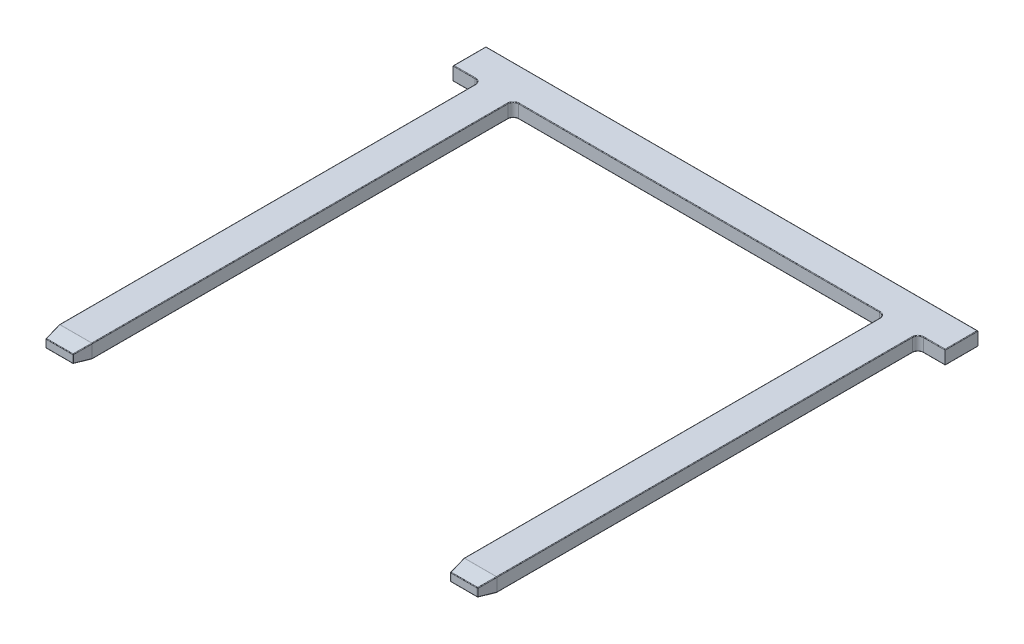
ISO-10303-21;
HEADER;
FILE_DESCRIPTION(('STEP AP214'),'2;1');
FILE_NAME('part.step','',(''),(''),'','','');
FILE_SCHEMA(('AUTOMOTIVE_DESIGN { 1 0 10303 214 1 1 1 1 }'));
ENDSEC;
DATA;
#1=APPLICATION_CONTEXT('core data for automotive mechanical design processes');
#2=APPLICATION_PROTOCOL_DEFINITION('international standard','automotive_design',2000,#1);
#3=PRODUCT_CONTEXT('',#1,'mechanical');
#4=PRODUCT('Part','Part','',(#3));
#5=PRODUCT_RELATED_PRODUCT_CATEGORY('part','',(#4));
#6=PRODUCT_DEFINITION_FORMATION('','',#4);
#7=PRODUCT_DEFINITION_CONTEXT('part definition',#1,'design');
#8=PRODUCT_DEFINITION('design','',#6,#7);
#9=PRODUCT_DEFINITION_SHAPE('','',#8);
#10=(LENGTH_UNIT() NAMED_UNIT(*) SI_UNIT(.MILLI.,.METRE.));
#11=(NAMED_UNIT(*) PLANE_ANGLE_UNIT() SI_UNIT($,.RADIAN.));
#12=(NAMED_UNIT(*) SI_UNIT($,.STERADIAN.) SOLID_ANGLE_UNIT());
#13=UNCERTAINTY_MEASURE_WITH_UNIT(LENGTH_MEASURE(1.E-05),#10,'distance_accuracy_value','');
#14=(GEOMETRIC_REPRESENTATION_CONTEXT(3) GLOBAL_UNCERTAINTY_ASSIGNED_CONTEXT((#13)) GLOBAL_UNIT_ASSIGNED_CONTEXT((#10,
#11,#12)) REPRESENTATION_CONTEXT('',''));
#15=CARTESIAN_POINT('',(0.,0.,0.));
#16=DIRECTION('',(0.,0.,1.));
#17=DIRECTION('',(1.,0.,0.));
#18=AXIS2_PLACEMENT_3D('',#15,#16,#17);
#19=CARTESIAN_POINT('',(0.,25.,830.));
#20=DIRECTION('',(0.,0.,-1.));
#21=DIRECTION('',(-1.,0.,0.));
#22=AXIS2_PLACEMENT_3D('',#19,#20,#21);
#23=PLANE('',#22);
#24=DIRECTION('',(-1.,0.,0.));
#25=VECTOR('',#24,1.);
#26=CARTESIAN_POINT('',(-345.,5.84712708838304,830.));
#27=LINE('',#26,#25);
#28=CARTESIAN_POINT('',(-394.152872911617,5.84712708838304,830.));
#29=VERTEX_POINT('',#28);
#30=CARTESIAN_POINT('',(-345.847127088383,5.84712708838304,830.));
#31=VERTEX_POINT('',#30);
#32=EDGE_CURVE('E637',#29,#31,#27,.F.);
#33=ORIENTED_EDGE('',*,*,#32,.T.);
#34=DIRECTION('',(0.,-1.,0.));
#35=VECTOR('',#34,1.);
#36=CARTESIAN_POINT('',(-345.847127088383,20.0000000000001,830.));
#37=LINE('',#36,#35);
#38=CARTESIAN_POINT('',(-345.847127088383,19.152872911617,830.));
#39=VERTEX_POINT('',#38);
#40=EDGE_CURVE('E639',#31,#39,#37,.F.);
#41=ORIENTED_EDGE('',*,*,#40,.T.);
#42=DIRECTION('',(-1.,0.,0.));
#43=VECTOR('',#42,1.);
#44=CARTESIAN_POINT('',(-395.,19.152872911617,830.));
#45=LINE('',#44,#43);
#46=CARTESIAN_POINT('',(-394.152872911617,19.152872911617,830.));
#47=VERTEX_POINT('',#46);
#48=EDGE_CURVE('E550',#39,#47,#45,.T.);
#49=ORIENTED_EDGE('',*,*,#48,.T.);
#50=DIRECTION('',(0.,1.,0.));
#51=VECTOR('',#50,1.);
#52=CARTESIAN_POINT('',(-394.152872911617,5.,830.));
#53=LINE('',#52,#51);
#54=EDGE_CURVE('E635',#47,#29,#53,.F.);
#55=ORIENTED_EDGE('',*,*,#54,.T.);
#56=EDGE_LOOP('',(#33,#41,#49,#55));
#57=FACE_BOUND('',#56,.T.);
#58=ADVANCED_FACE('F37',(#57),#23,.F.);
#59=CARTESIAN_POINT('',(-340.,25.,0.));
#60=DIRECTION('',(-1.,0.,0.));
#61=DIRECTION('',(0.,0.,1.));
#62=AXIS2_PLACEMENT_3D('',#59,#60,#61);
#63=PLANE('',#62);
#64=DIRECTION('',(0.,-1.,0.));
#65=VECTOR('',#64,1.);
#66=CARTESIAN_POINT('',(-340.,25.,800.));
#67=LINE('',#66,#65);
#68=CARTESIAN_POINT('',(-340.,24.,800.));
#69=VERTEX_POINT('',#68);
#70=CARTESIAN_POINT('',(-340.,1.,800.));
#71=VERTEX_POINT('',#70);
#72=EDGE_CURVE('E967',#69,#71,#67,.T.);
#73=ORIENTED_EDGE('',*,*,#72,.T.);
#74=DIRECTION('',(0.,0.,-1.));
#75=VECTOR('',#74,1.);
#76=CARTESIAN_POINT('',(-340.,1.,0.));
#77=LINE('',#76,#75);
#78=CARTESIAN_POINT('',(-340.,1.,40.));
#79=VERTEX_POINT('',#78);
#80=EDGE_CURVE('E469',#71,#79,#77,.T.);
#81=ORIENTED_EDGE('',*,*,#80,.T.);
#82=DIRECTION('',(0.,-1.,0.));
#83=VECTOR('',#82,1.);
#84=CARTESIAN_POINT('',(-340.,25.,40.));
#85=LINE('',#84,#83);
#86=CARTESIAN_POINT('',(-340.,24.,40.));
#87=VERTEX_POINT('',#86);
#88=EDGE_CURVE('E961',#79,#87,#85,.F.);
#89=ORIENTED_EDGE('',*,*,#88,.T.);
#90=DIRECTION('',(0.,0.,-1.));
#91=VECTOR('',#90,1.);
#92=CARTESIAN_POINT('',(-340.,24.,800.));
#93=LINE('',#92,#91);
#94=EDGE_CURVE('E467',#87,#69,#93,.F.);
#95=ORIENTED_EDGE('',*,*,#94,.T.);
#96=EDGE_LOOP('',(#73,#81,#89,#95));
#97=FACE_BOUND('',#96,.T.);
#98=ADVANCED_FACE('F1110',(#97),#63,.F.);
#99=CARTESIAN_POINT('',(0.,25.,30.));
#100=DIRECTION('',(0.,0.,1.));
#101=DIRECTION('',(1.,0.,0.));
#102=AXIS2_PLACEMENT_3D('',#99,#100,#101);
#103=PLANE('',#102);
#104=DIRECTION('',(0.,-1.,0.));
#105=VECTOR('',#104,1.);
#106=CARTESIAN_POINT('',(-330.,25.,30.));
#107=LINE('',#106,#105);
#108=CARTESIAN_POINT('',(-330.,24.,30.));
#109=VERTEX_POINT('',#108);
#110=CARTESIAN_POINT('',(-330.,1.,30.));
#111=VERTEX_POINT('',#110);
#112=EDGE_CURVE('E943',#109,#111,#107,.T.);
#113=ORIENTED_EDGE('',*,*,#112,.T.);
#114=DIRECTION('',(-1.,0.,0.));
#115=VECTOR('',#114,1.);
#116=CARTESIAN_POINT('',(330.,1.,30.));
#117=LINE('',#116,#115);
#118=CARTESIAN_POINT('',(330.,1.,30.));
#119=VERTEX_POINT('',#118);
#120=EDGE_CURVE('E482',#111,#119,#117,.F.);
#121=ORIENTED_EDGE('',*,*,#120,.T.);
#122=DIRECTION('',(0.,-1.,0.));
#123=VECTOR('',#122,1.);
#124=CARTESIAN_POINT('',(330.,25.,30.));
#125=LINE('',#124,#123);
#126=CARTESIAN_POINT('',(330.,24.,30.));
#127=VERTEX_POINT('',#126);
#128=EDGE_CURVE('E947',#119,#127,#125,.F.);
#129=ORIENTED_EDGE('',*,*,#128,.T.);
#130=DIRECTION('',(-1.,0.,0.));
#131=VECTOR('',#130,1.);
#132=CARTESIAN_POINT('',(0.,24.,30.));
#133=LINE('',#132,#131);
#134=EDGE_CURVE('E480',#127,#109,#133,.T.);
#135=ORIENTED_EDGE('',*,*,#134,.T.);
#136=EDGE_LOOP('',(#113,#121,#129,#135));
#137=FACE_BOUND('',#136,.T.);
#138=ADVANCED_FACE('F1127',(#137),#103,.T.);
#139=CARTESIAN_POINT('',(340.,25.,0.));
#140=DIRECTION('',(1.,0.,0.));
#141=DIRECTION('',(0.,0.,-1.));
#142=AXIS2_PLACEMENT_3D('',#139,#140,#141);
#143=PLANE('',#142);
#144=DIRECTION('',(0.,-1.,0.));
#145=VECTOR('',#144,1.);
#146=CARTESIAN_POINT('',(340.,25.,40.));
#147=LINE('',#146,#145);
#148=CARTESIAN_POINT('',(340.,24.,40.));
#149=VERTEX_POINT('',#148);
#150=CARTESIAN_POINT('',(340.,1.,40.));
#151=VERTEX_POINT('',#150);
#152=EDGE_CURVE('E934',#149,#151,#147,.T.);
#153=ORIENTED_EDGE('',*,*,#152,.T.);
#154=DIRECTION('',(0.,0.,1.));
#155=VECTOR('',#154,1.);
#156=CARTESIAN_POINT('',(340.,1.,0.));
#157=LINE('',#156,#155);
#158=CARTESIAN_POINT('',(340.,1.,799.999999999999));
#159=VERTEX_POINT('',#158);
#160=EDGE_CURVE('E491',#151,#159,#157,.T.);
#161=ORIENTED_EDGE('',*,*,#160,.T.);
#162=DIRECTION('',(0.,1.,0.));
#163=VECTOR('',#162,1.);
#164=CARTESIAN_POINT('',(340.,25.,799.999999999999));
#165=LINE('',#164,#163);
#166=CARTESIAN_POINT('',(340.,24.,799.999999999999));
#167=VERTEX_POINT('',#166);
#168=EDGE_CURVE('E937',#159,#167,#165,.T.);
#169=ORIENTED_EDGE('',*,*,#168,.T.);
#170=DIRECTION('',(0.,0.,1.));
#171=VECTOR('',#170,1.);
#172=CARTESIAN_POINT('',(340.,24.,40.));
#173=LINE('',#172,#171);
#174=EDGE_CURVE('E489',#167,#149,#173,.F.);
#175=ORIENTED_EDGE('',*,*,#174,.T.);
#176=EDGE_LOOP('',(#153,#161,#169,#175));
#177=FACE_BOUND('',#176,.T.);
#178=ADVANCED_FACE('F933',(#177),#143,.F.);
#179=CARTESIAN_POINT('',(0.,25.,830.));
#180=DIRECTION('',(0.,0.,-1.));
#181=DIRECTION('',(-1.,0.,0.));
#182=AXIS2_PLACEMENT_3D('',#179,#180,#181);
#183=PLANE('',#182);
#184=DIRECTION('',(-1.,0.,0.));
#185=VECTOR('',#184,1.);
#186=CARTESIAN_POINT('',(395.,5.84712708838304,830.));
#187=LINE('',#186,#185);
#188=CARTESIAN_POINT('',(345.847127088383,5.84712708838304,830.));
#189=VERTEX_POINT('',#188);
#190=CARTESIAN_POINT('',(394.152872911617,5.84712708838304,830.));
#191=VERTEX_POINT('',#190);
#192=EDGE_CURVE('E702',#189,#191,#187,.F.);
#193=ORIENTED_EDGE('',*,*,#192,.T.);
#194=DIRECTION('',(0.,-1.,0.));
#195=VECTOR('',#194,1.);
#196=CARTESIAN_POINT('',(394.152872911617,20.0000000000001,830.));
#197=LINE('',#196,#195);
#198=CARTESIAN_POINT('',(394.152872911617,19.152872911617,830.));
#199=VERTEX_POINT('',#198);
#200=EDGE_CURVE('E704',#191,#199,#197,.F.);
#201=ORIENTED_EDGE('',*,*,#200,.T.);
#202=DIRECTION('',(-1.,0.,0.));
#203=VECTOR('',#202,1.);
#204=CARTESIAN_POINT('',(345.,19.152872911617,830.));
#205=LINE('',#204,#203);
#206=CARTESIAN_POINT('',(345.847127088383,19.152872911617,830.));
#207=VERTEX_POINT('',#206);
#208=EDGE_CURVE('E698',#199,#207,#205,.T.);
#209=ORIENTED_EDGE('',*,*,#208,.T.);
#210=DIRECTION('',(0.,1.,0.));
#211=VECTOR('',#210,1.);
#212=CARTESIAN_POINT('',(345.847127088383,5.,830.));
#213=LINE('',#212,#211);
#214=EDGE_CURVE('E700',#207,#189,#213,.F.);
#215=ORIENTED_EDGE('',*,*,#214,.T.);
#216=EDGE_LOOP('',(#193,#201,#209,#215));
#217=FACE_BOUND('',#216,.T.);
#218=ADVANCED_FACE('F832',(#217),#183,.F.);
#219=CARTESIAN_POINT('',(400.,25.,0.));
#220=DIRECTION('',(-1.,0.,0.));
#221=DIRECTION('',(0.,0.,1.));
#222=AXIS2_PLACEMENT_3D('',#219,#220,#221);
#223=PLANE('',#222);
#224=DIRECTION('',(0.,-1.,0.));
#225=VECTOR('',#224,1.);
#226=CARTESIAN_POINT('',(400.,25.,800.));
#227=LINE('',#226,#225);
#228=CARTESIAN_POINT('',(400.,24.,800.));
#229=VERTEX_POINT('',#228);
#230=CARTESIAN_POINT('',(400.,1.,800.));
#231=VERTEX_POINT('',#230);
#232=EDGE_CURVE('E964',#229,#231,#227,.T.);
#233=ORIENTED_EDGE('',*,*,#232,.T.);
#234=DIRECTION('',(0.,0.,-1.));
#235=VECTOR('',#234,1.);
#236=CARTESIAN_POINT('',(400.,1.,0.));
#237=LINE('',#236,#235);
#238=CARTESIAN_POINT('',(400.,1.,40.));
#239=VERTEX_POINT('',#238);
#240=EDGE_CURVE('E503',#231,#239,#237,.T.);
#241=ORIENTED_EDGE('',*,*,#240,.T.);
#242=DIRECTION('',(0.,-1.,0.));
#243=VECTOR('',#242,1.);
#244=CARTESIAN_POINT('',(400.,25.,40.));
#245=LINE('',#244,#243);
#246=CARTESIAN_POINT('',(400.,24.,40.));
#247=VERTEX_POINT('',#246);
#248=EDGE_CURVE('E944',#239,#247,#245,.F.);
#249=ORIENTED_EDGE('',*,*,#248,.T.);
#250=DIRECTION('',(0.,0.,-1.));
#251=VECTOR('',#250,1.);
#252=CARTESIAN_POINT('',(400.,24.,800.));
#253=LINE('',#252,#251);
#254=EDGE_CURVE('E501',#247,#229,#253,.F.);
#255=ORIENTED_EDGE('',*,*,#254,.T.);
#256=EDGE_LOOP('',(#233,#241,#249,#255));
#257=FACE_BOUND('',#256,.T.);
#258=ADVANCED_FACE('F1599',(#257),#223,.F.);
#259=DIRECTION('',(0.,-1.,0.));
#260=VECTOR('',#259,1.);
#261=CARTESIAN_POINT('',(410.,25.,30.));
#262=LINE('',#261,#260);
#263=CARTESIAN_POINT('',(410.,24.,30.));
#264=VERTEX_POINT('',#263);
#265=CARTESIAN_POINT('',(410.,1.,30.));
#266=VERTEX_POINT('',#265);
#267=EDGE_CURVE('E950',#264,#266,#262,.T.);
#268=ORIENTED_EDGE('',*,*,#267,.T.);
#269=DIRECTION('',(-1.,0.,0.));
#270=VECTOR('',#269,1.);
#271=CARTESIAN_POINT('',(450.,1.,30.));
#272=LINE('',#271,#270);
#273=CARTESIAN_POINT('',(450.,1.,30.));
#274=VERTEX_POINT('',#273);
#275=EDGE_CURVE('E433',#266,#274,#272,.F.);
#276=ORIENTED_EDGE('',*,*,#275,.T.);
#277=DIRECTION('',(0.,-1.,0.));
#278=VECTOR('',#277,1.);
#279=CARTESIAN_POINT('',(450.,25.,30.));
#280=LINE('',#279,#278);
#281=CARTESIAN_POINT('',(450.,24.,30.));
#282=VERTEX_POINT('',#281);
#283=EDGE_CURVE('E1015',#282,#274,#280,.T.);
#284=ORIENTED_EDGE('',*,*,#283,.F.);
#285=DIRECTION('',(-1.,0.,0.));
#286=VECTOR('',#285,1.);
#287=CARTESIAN_POINT('',(0.,24.,30.));
#288=LINE('',#287,#286);
#289=EDGE_CURVE('E431',#282,#264,#288,.T.);
#290=ORIENTED_EDGE('',*,*,#289,.T.);
#291=EDGE_LOOP('',(#268,#276,#284,#290));
#292=FACE_BOUND('',#291,.T.);
#293=ADVANCED_FACE('F1014',(#292),#103,.T.);
#294=CARTESIAN_POINT('',(450.,25.,0.));
#295=DIRECTION('',(-1.,0.,0.));
#296=DIRECTION('',(0.,0.,1.));
#297=AXIS2_PLACEMENT_3D('',#294,#295,#296);
#298=PLANE('',#297);
#299=ORIENTED_EDGE('',*,*,#283,.T.);
#300=DIRECTION('',(0.,0.,-1.));
#301=VECTOR('',#300,1.);
#302=CARTESIAN_POINT('',(450.,1.,0.));
#303=LINE('',#302,#301);
#304=CARTESIAN_POINT('',(450.,1.,-30.0000000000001));
#305=VERTEX_POINT('',#304);
#306=EDGE_CURVE('E437',#274,#305,#303,.T.);
#307=ORIENTED_EDGE('',*,*,#306,.T.);
#308=DIRECTION('',(0.,-1.,0.));
#309=VECTOR('',#308,1.);
#310=CARTESIAN_POINT('',(450.,25.,-30.0000000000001));
#311=LINE('',#310,#309);
#312=CARTESIAN_POINT('',(450.,24.,-30.0000000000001));
#313=VERTEX_POINT('',#312);
#314=EDGE_CURVE('E1016',#313,#305,#311,.T.);
#315=ORIENTED_EDGE('',*,*,#314,.F.);
#316=DIRECTION('',(0.,0.,-1.));
#317=VECTOR('',#316,1.);
#318=CARTESIAN_POINT('',(450.,24.,30.));
#319=LINE('',#318,#317);
#320=EDGE_CURVE('E435',#313,#282,#319,.F.);
#321=ORIENTED_EDGE('',*,*,#320,.T.);
#322=EDGE_LOOP('',(#299,#307,#315,#321));
#323=FACE_BOUND('',#322,.T.);
#324=ADVANCED_FACE('F1584',(#323),#298,.F.);
#325=CARTESIAN_POINT('',(0.,25.,-30.));
#326=DIRECTION('',(0.,0.,1.));
#327=DIRECTION('',(1.,0.,0.));
#328=AXIS2_PLACEMENT_3D('',#325,#326,#327);
#329=PLANE('',#328);
#330=ORIENTED_EDGE('',*,*,#314,.T.);
#331=DIRECTION('',(-1.,0.,0.));
#332=VECTOR('',#331,1.);
#333=CARTESIAN_POINT('',(0.,1.,-30.));
#334=LINE('',#333,#332);
#335=CARTESIAN_POINT('',(-450.,1.,-29.9999999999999));
#336=VERTEX_POINT('',#335);
#337=EDGE_CURVE('E441',#305,#336,#334,.T.);
#338=ORIENTED_EDGE('',*,*,#337,.T.);
#339=DIRECTION('',(0.,-1.,0.));
#340=VECTOR('',#339,1.);
#341=CARTESIAN_POINT('',(-450.,25.,-29.9999999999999));
#342=LINE('',#341,#340);
#343=CARTESIAN_POINT('',(-450.,24.,-29.9999999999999));
#344=VERTEX_POINT('',#343);
#345=EDGE_CURVE('E1021',#344,#336,#342,.T.);
#346=ORIENTED_EDGE('',*,*,#345,.F.);
#347=DIRECTION('',(-1.,0.,0.));
#348=VECTOR('',#347,1.);
#349=CARTESIAN_POINT('',(450.,24.,-30.0000000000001));
#350=LINE('',#349,#348);
#351=EDGE_CURVE('E439',#344,#313,#350,.F.);
#352=ORIENTED_EDGE('',*,*,#351,.T.);
#353=EDGE_LOOP('',(#330,#338,#346,#352));
#354=FACE_BOUND('',#353,.T.);
#355=ADVANCED_FACE('F1577',(#354),#329,.F.);
#356=CARTESIAN_POINT('',(-450.,25.,0.));
#357=DIRECTION('',(-1.,0.,0.));
#358=DIRECTION('',(0.,0.,1.));
#359=AXIS2_PLACEMENT_3D('',#356,#357,#358);
#360=PLANE('',#359);
#361=ORIENTED_EDGE('',*,*,#345,.T.);
#362=DIRECTION('',(0.,0.,-1.));
#363=VECTOR('',#362,1.);
#364=CARTESIAN_POINT('',(-450.,1.,30.0000000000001));
#365=LINE('',#364,#363);
#366=CARTESIAN_POINT('',(-450.,1.,30.0000000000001));
#367=VERTEX_POINT('',#366);
#368=EDGE_CURVE('E445',#336,#367,#365,.F.);
#369=ORIENTED_EDGE('',*,*,#368,.T.);
#370=DIRECTION('',(0.,-1.,0.));
#371=VECTOR('',#370,1.);
#372=CARTESIAN_POINT('',(-450.,25.,30.0000000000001));
#373=LINE('',#372,#371);
#374=CARTESIAN_POINT('',(-450.,24.,30.0000000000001));
#375=VERTEX_POINT('',#374);
#376=EDGE_CURVE('E591',#375,#367,#373,.T.);
#377=ORIENTED_EDGE('',*,*,#376,.F.);
#378=DIRECTION('',(0.,0.,-1.));
#379=VECTOR('',#378,1.);
#380=CARTESIAN_POINT('',(-450.,24.,0.));
#381=LINE('',#380,#379);
#382=EDGE_CURVE('E443',#375,#344,#381,.T.);
#383=ORIENTED_EDGE('',*,*,#382,.T.);
#384=EDGE_LOOP('',(#361,#369,#377,#383));
#385=FACE_BOUND('',#384,.T.);
#386=ADVANCED_FACE('F1570',(#385),#360,.T.);
#387=ORIENTED_EDGE('',*,*,#376,.T.);
#388=DIRECTION('',(-1.,0.,0.));
#389=VECTOR('',#388,1.);
#390=CARTESIAN_POINT('',(-410.,1.,30.0000000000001));
#391=LINE('',#390,#389);
#392=CARTESIAN_POINT('',(-410.,1.,30.0000000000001));
#393=VERTEX_POINT('',#392);
#394=EDGE_CURVE('E449',#367,#393,#391,.F.);
#395=ORIENTED_EDGE('',*,*,#394,.T.);
#396=DIRECTION('',(0.,-1.,0.));
#397=VECTOR('',#396,1.);
#398=CARTESIAN_POINT('',(-410.,25.,30.0000000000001));
#399=LINE('',#398,#397);
#400=CARTESIAN_POINT('',(-410.,24.,30.0000000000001));
#401=VERTEX_POINT('',#400);
#402=EDGE_CURVE('E958',#393,#401,#399,.F.);
#403=ORIENTED_EDGE('',*,*,#402,.T.);
#404=DIRECTION('',(-1.,0.,0.));
#405=VECTOR('',#404,1.);
#406=CARTESIAN_POINT('',(0.,24.,30.));
#407=LINE('',#406,#405);
#408=EDGE_CURVE('E447',#401,#375,#407,.T.);
#409=ORIENTED_EDGE('',*,*,#408,.T.);
#410=EDGE_LOOP('',(#387,#395,#403,#409));
#411=FACE_BOUND('',#410,.T.);
#412=ADVANCED_FACE('F1028',(#411),#103,.T.);
#413=CARTESIAN_POINT('',(-400.,25.,0.));
#414=DIRECTION('',(1.,0.,0.));
#415=DIRECTION('',(0.,0.,-1.));
#416=AXIS2_PLACEMENT_3D('',#413,#414,#415);
#417=PLANE('',#416);
#418=DIRECTION('',(0.,-1.,0.));
#419=VECTOR('',#418,1.);
#420=CARTESIAN_POINT('',(-400.,25.,40.0000000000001));
#421=LINE('',#420,#419);
#422=CARTESIAN_POINT('',(-400.,24.,40.0000000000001));
#423=VERTEX_POINT('',#422);
#424=CARTESIAN_POINT('',(-400.,1.,40.0000000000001));
#425=VERTEX_POINT('',#424);
#426=EDGE_CURVE('E955',#423,#425,#421,.T.);
#427=ORIENTED_EDGE('',*,*,#426,.T.);
#428=DIRECTION('',(0.,0.,1.));
#429=VECTOR('',#428,1.);
#430=CARTESIAN_POINT('',(-400.,1.,0.));
#431=LINE('',#430,#429);
#432=CARTESIAN_POINT('',(-400.,1.,799.999999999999));
#433=VERTEX_POINT('',#432);
#434=EDGE_CURVE('E457',#425,#433,#431,.T.);
#435=ORIENTED_EDGE('',*,*,#434,.T.);
#436=DIRECTION('',(0.,1.,0.));
#437=VECTOR('',#436,1.);
#438=CARTESIAN_POINT('',(-400.,25.,799.999999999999));
#439=LINE('',#438,#437);
#440=CARTESIAN_POINT('',(-400.,24.,799.999999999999));
#441=VERTEX_POINT('',#440);
#442=EDGE_CURVE('E417',#433,#441,#439,.T.);
#443=ORIENTED_EDGE('',*,*,#442,.T.);
#444=DIRECTION('',(0.,0.,1.));
#445=VECTOR('',#444,1.);
#446=CARTESIAN_POINT('',(-400.,24.,40.0000000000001));
#447=LINE('',#446,#445);
#448=EDGE_CURVE('E455',#441,#423,#447,.F.);
#449=ORIENTED_EDGE('',*,*,#448,.T.);
#450=EDGE_LOOP('',(#427,#435,#443,#449));
#451=FACE_BOUND('',#450,.T.);
#452=ADVANCED_FACE('F1052',(#451),#417,.F.);
#453=CARTESIAN_POINT('',(0.,25.,0.));
#454=DIRECTION('',(0.,1.,0.));
#455=DIRECTION('',(0.,0.,1.));
#456=AXIS2_PLACEMENT_3D('',#453,#454,#455);
#457=PLANE('',#456);
#458=DIRECTION('',(-1.,0.,0.));
#459=VECTOR('',#458,1.);
#460=CARTESIAN_POINT('',(0.,25.,29.));
#461=LINE('',#460,#459);
#462=CARTESIAN_POINT('',(-330.,25.,29.));
#463=VERTEX_POINT('',#462);
#464=CARTESIAN_POINT('',(330.,25.,29.));
#465=VERTEX_POINT('',#464);
#466=EDGE_CURVE('E540',#463,#465,#461,.F.);
#467=ORIENTED_EDGE('',*,*,#466,.T.);
#468=CARTESIAN_POINT('',(330.,25.,40.));
#469=DIRECTION('',(0.,1.,0.));
#470=DIRECTION('',(0.,0.,1.));
#471=AXIS2_PLACEMENT_3D('',#468,#469,#470);
#472=CIRCLE('',#471,11.);
#473=CARTESIAN_POINT('',(341.,25.,40.));
#474=VERTEX_POINT('',#473);
#475=EDGE_CURVE('E542',#465,#474,#472,.F.);
#476=ORIENTED_EDGE('',*,*,#475,.T.);
#477=DIRECTION('',(0.,0.,1.));
#478=VECTOR('',#477,1.);
#479=CARTESIAN_POINT('',(341.,25.,800.));
#480=LINE('',#479,#478);
#481=CARTESIAN_POINT('',(341.,25.,799.917237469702));
#482=VERTEX_POINT('',#481);
#483=EDGE_CURVE('E510',#474,#482,#480,.T.);
#484=ORIENTED_EDGE('',*,*,#483,.T.);
#485=DIRECTION('',(1.,0.,0.));
#486=VECTOR('',#485,1.);
#487=CARTESIAN_POINT('',(0.,25.,799.917237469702));
#488=LINE('',#487,#486);
#489=CARTESIAN_POINT('',(399.,25.,799.917237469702));
#490=VERTEX_POINT('',#489);
#491=EDGE_CURVE('E513',#482,#490,#488,.T.);
#492=ORIENTED_EDGE('',*,*,#491,.T.);
#493=DIRECTION('',(0.,0.,-1.));
#494=VECTOR('',#493,1.);
#495=CARTESIAN_POINT('',(399.,25.,40.));
#496=LINE('',#495,#494);
#497=CARTESIAN_POINT('',(399.,25.,40.));
#498=VERTEX_POINT('',#497);
#499=EDGE_CURVE('E516',#490,#498,#496,.T.);
#500=ORIENTED_EDGE('',*,*,#499,.T.);
#501=CARTESIAN_POINT('',(410.,25.,40.));
#502=DIRECTION('',(0.,1.,0.));
#503=DIRECTION('',(0.,0.,1.));
#504=AXIS2_PLACEMENT_3D('',#501,#502,#503);
#505=CIRCLE('',#504,11.);
#506=CARTESIAN_POINT('',(410.,25.,29.));
#507=VERTEX_POINT('',#506);
#508=EDGE_CURVE('E518',#498,#507,#505,.F.);
#509=ORIENTED_EDGE('',*,*,#508,.T.);
#510=DIRECTION('',(-1.,0.,0.));
#511=VECTOR('',#510,1.);
#512=CARTESIAN_POINT('',(0.,25.,29.));
#513=LINE('',#512,#511);
#514=CARTESIAN_POINT('',(449.,25.,29.));
#515=VERTEX_POINT('',#514);
#516=EDGE_CURVE('E520',#507,#515,#513,.F.);
#517=ORIENTED_EDGE('',*,*,#516,.T.);
#518=DIRECTION('',(0.,0.,-1.));
#519=VECTOR('',#518,1.);
#520=CARTESIAN_POINT('',(449.,25.,-30.0000000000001));
#521=LINE('',#520,#519);
#522=CARTESIAN_POINT('',(449.,25.,-29.0000000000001));
#523=VERTEX_POINT('',#522);
#524=EDGE_CURVE('E522',#515,#523,#521,.T.);
#525=ORIENTED_EDGE('',*,*,#524,.T.);
#526=DIRECTION('',(-1.,0.,0.));
#527=VECTOR('',#526,1.);
#528=CARTESIAN_POINT('',(-450.,25.,-28.9999999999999));
#529=LINE('',#528,#527);
#530=CARTESIAN_POINT('',(-449.,25.,-28.9999999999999));
#531=VERTEX_POINT('',#530);
#532=EDGE_CURVE('E524',#523,#531,#529,.T.);
#533=ORIENTED_EDGE('',*,*,#532,.T.);
#534=DIRECTION('',(0.,0.,-1.));
#535=VECTOR('',#534,1.);
#536=CARTESIAN_POINT('',(-449.,25.,0.));
#537=LINE('',#536,#535);
#538=CARTESIAN_POINT('',(-449.,25.,29.0000000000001));
#539=VERTEX_POINT('',#538);
#540=EDGE_CURVE('E526',#531,#539,#537,.F.);
#541=ORIENTED_EDGE('',*,*,#540,.T.);
#542=DIRECTION('',(-1.,0.,0.));
#543=VECTOR('',#542,1.);
#544=CARTESIAN_POINT('',(0.,25.,29.));
#545=LINE('',#544,#543);
#546=CARTESIAN_POINT('',(-410.,25.,29.0000000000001));
#547=VERTEX_POINT('',#546);
#548=EDGE_CURVE('E528',#539,#547,#545,.F.);
#549=ORIENTED_EDGE('',*,*,#548,.T.);
#550=CARTESIAN_POINT('',(-410.,25.,40.0000000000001));
#551=DIRECTION('',(0.,1.,0.));
#552=DIRECTION('',(0.,0.,1.));
#553=AXIS2_PLACEMENT_3D('',#550,#551,#552);
#554=CIRCLE('',#553,11.);
#555=CARTESIAN_POINT('',(-399.,25.,40.0000000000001));
#556=VERTEX_POINT('',#555);
#557=EDGE_CURVE('E530',#547,#556,#554,.F.);
#558=ORIENTED_EDGE('',*,*,#557,.T.);
#559=DIRECTION('',(0.,0.,1.));
#560=VECTOR('',#559,1.);
#561=CARTESIAN_POINT('',(-399.,25.,800.));
#562=LINE('',#561,#560);
#563=CARTESIAN_POINT('',(-399.,25.,799.917237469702));
#564=VERTEX_POINT('',#563);
#565=EDGE_CURVE('E532',#556,#564,#562,.T.);
#566=ORIENTED_EDGE('',*,*,#565,.T.);
#567=DIRECTION('',(1.,0.,0.));
#568=VECTOR('',#567,1.);
#569=CARTESIAN_POINT('',(0.,25.,799.917237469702));
#570=LINE('',#569,#568);
#571=CARTESIAN_POINT('',(-341.,25.,799.917237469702));
#572=VERTEX_POINT('',#571);
#573=EDGE_CURVE('E534',#564,#572,#570,.T.);
#574=ORIENTED_EDGE('',*,*,#573,.T.);
#575=DIRECTION('',(0.,0.,-1.));
#576=VECTOR('',#575,1.);
#577=CARTESIAN_POINT('',(-341.,25.,40.));
#578=LINE('',#577,#576);
#579=CARTESIAN_POINT('',(-341.,25.,40.));
#580=VERTEX_POINT('',#579);
#581=EDGE_CURVE('E536',#572,#580,#578,.T.);
#582=ORIENTED_EDGE('',*,*,#581,.T.);
#583=CARTESIAN_POINT('',(-330.,25.,40.));
#584=DIRECTION('',(0.,1.,0.));
#585=DIRECTION('',(0.,0.,1.));
#586=AXIS2_PLACEMENT_3D('',#583,#584,#585);
#587=CIRCLE('',#586,11.);
#588=EDGE_CURVE('E538',#580,#463,#587,.F.);
#589=ORIENTED_EDGE('',*,*,#588,.T.);
#590=EDGE_LOOP('',(#467,#476,#484,#492,#500,#509,#517,#525,#533,#541,#549,#558,#566,#574,#582,#589));
#591=FACE_BOUND('',#590,.T.);
#592=ADVANCED_FACE('F860',(#591),#457,.T.);
#593=CARTESIAN_POINT('',(0.,0.,0.));
#594=DIRECTION('',(0.,1.,0.));
#595=DIRECTION('',(0.,0.,1.));
#596=AXIS2_PLACEMENT_3D('',#593,#594,#595);
#597=PLANE('',#596);
#598=DIRECTION('',(-1.,0.,0.));
#599=VECTOR('',#598,1.);
#600=CARTESIAN_POINT('',(410.,0.,29.));
#601=LINE('',#600,#599);
#602=CARTESIAN_POINT('',(449.,0.,29.));
#603=VERTEX_POINT('',#602);
#604=CARTESIAN_POINT('',(410.,0.,29.));
#605=VERTEX_POINT('',#604);
#606=EDGE_CURVE('E421',#603,#605,#601,.T.);
#607=ORIENTED_EDGE('',*,*,#606,.T.);
#608=CARTESIAN_POINT('',(410.,0.,40.));
#609=DIRECTION('',(0.,1.,0.));
#610=DIRECTION('',(0.,0.,1.));
#611=AXIS2_PLACEMENT_3D('',#608,#609,#610);
#612=CIRCLE('',#611,11.);
#613=CARTESIAN_POINT('',(399.,0.,40.));
#614=VERTEX_POINT('',#613);
#615=EDGE_CURVE('E399',#605,#614,#612,.T.);
#616=ORIENTED_EDGE('',*,*,#615,.T.);
#617=DIRECTION('',(0.,0.,-1.));
#618=VECTOR('',#617,1.);
#619=CARTESIAN_POINT('',(399.,0.,0.));
#620=LINE('',#619,#618);
#621=CARTESIAN_POINT('',(399.,0.,799.917237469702));
#622=VERTEX_POINT('',#621);
#623=EDGE_CURVE('E408',#614,#622,#620,.F.);
#624=ORIENTED_EDGE('',*,*,#623,.T.);
#625=DIRECTION('',(1.,0.,0.));
#626=VECTOR('',#625,1.);
#627=CARTESIAN_POINT('',(340.,0.,799.917237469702));
#628=LINE('',#627,#626);
#629=CARTESIAN_POINT('',(341.,0.,799.917237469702));
#630=VERTEX_POINT('',#629);
#631=EDGE_CURVE('E416',#622,#630,#628,.F.);
#632=ORIENTED_EDGE('',*,*,#631,.T.);
#633=DIRECTION('',(0.,0.,1.));
#634=VECTOR('',#633,1.);
#635=CARTESIAN_POINT('',(341.,0.,0.));
#636=LINE('',#635,#634);
#637=CARTESIAN_POINT('',(341.,0.,40.));
#638=VERTEX_POINT('',#637);
#639=EDGE_CURVE('E974',#630,#638,#636,.F.);
#640=ORIENTED_EDGE('',*,*,#639,.T.);
#641=CARTESIAN_POINT('',(330.,0.,40.));
#642=DIRECTION('',(0.,1.,0.));
#643=DIRECTION('',(0.,0.,1.));
#644=AXIS2_PLACEMENT_3D('',#641,#642,#643);
#645=CIRCLE('',#644,11.);
#646=CARTESIAN_POINT('',(330.,0.,29.));
#647=VERTEX_POINT('',#646);
#648=EDGE_CURVE('E976',#638,#647,#645,.T.);
#649=ORIENTED_EDGE('',*,*,#648,.T.);
#650=DIRECTION('',(-1.,0.,0.));
#651=VECTOR('',#650,1.);
#652=CARTESIAN_POINT('',(-330.,0.,29.));
#653=LINE('',#652,#651);
#654=CARTESIAN_POINT('',(-330.,0.,29.));
#655=VERTEX_POINT('',#654);
#656=EDGE_CURVE('E978',#647,#655,#653,.T.);
#657=ORIENTED_EDGE('',*,*,#656,.T.);
#658=CARTESIAN_POINT('',(-330.,0.,40.));
#659=DIRECTION('',(0.,1.,0.));
#660=DIRECTION('',(0.,0.,1.));
#661=AXIS2_PLACEMENT_3D('',#658,#659,#660);
#662=CIRCLE('',#661,11.);
#663=CARTESIAN_POINT('',(-341.,0.,40.));
#664=VERTEX_POINT('',#663);
#665=EDGE_CURVE('E980',#655,#664,#662,.T.);
#666=ORIENTED_EDGE('',*,*,#665,.T.);
#667=DIRECTION('',(0.,0.,-1.));
#668=VECTOR('',#667,1.);
#669=CARTESIAN_POINT('',(-341.,0.,0.));
#670=LINE('',#669,#668);
#671=CARTESIAN_POINT('',(-341.,0.,799.917237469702));
#672=VERTEX_POINT('',#671);
#673=EDGE_CURVE('E982',#664,#672,#670,.F.);
#674=ORIENTED_EDGE('',*,*,#673,.T.);
#675=DIRECTION('',(1.,0.,0.));
#676=VECTOR('',#675,1.);
#677=CARTESIAN_POINT('',(-400.,0.,799.917237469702));
#678=LINE('',#677,#676);
#679=CARTESIAN_POINT('',(-399.,0.,799.917237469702));
#680=VERTEX_POINT('',#679);
#681=EDGE_CURVE('E985',#672,#680,#678,.F.);
#682=ORIENTED_EDGE('',*,*,#681,.T.);
#683=DIRECTION('',(0.,0.,1.));
#684=VECTOR('',#683,1.);
#685=CARTESIAN_POINT('',(-399.,0.,0.));
#686=LINE('',#685,#684);
#687=CARTESIAN_POINT('',(-399.,0.,40.0000000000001));
#688=VERTEX_POINT('',#687);
#689=EDGE_CURVE('E987',#680,#688,#686,.F.);
#690=ORIENTED_EDGE('',*,*,#689,.T.);
#691=CARTESIAN_POINT('',(-410.,0.,40.0000000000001));
#692=DIRECTION('',(0.,1.,0.));
#693=DIRECTION('',(0.,0.,1.));
#694=AXIS2_PLACEMENT_3D('',#691,#692,#693);
#695=CIRCLE('',#694,11.);
#696=CARTESIAN_POINT('',(-410.,0.,29.0000000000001));
#697=VERTEX_POINT('',#696);
#698=EDGE_CURVE('E989',#688,#697,#695,.T.);
#699=ORIENTED_EDGE('',*,*,#698,.T.);
#700=DIRECTION('',(-1.,0.,0.));
#701=VECTOR('',#700,1.);
#702=CARTESIAN_POINT('',(-450.,0.,29.0000000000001));
#703=LINE('',#702,#701);
#704=CARTESIAN_POINT('',(-449.,0.,29.0000000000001));
#705=VERTEX_POINT('',#704);
#706=EDGE_CURVE('E991',#697,#705,#703,.T.);
#707=ORIENTED_EDGE('',*,*,#706,.T.);
#708=DIRECTION('',(0.,0.,-1.));
#709=VECTOR('',#708,1.);
#710=CARTESIAN_POINT('',(-449.,0.,-29.9999999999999));
#711=LINE('',#710,#709);
#712=CARTESIAN_POINT('',(-449.,0.,-28.9999999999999));
#713=VERTEX_POINT('',#712);
#714=EDGE_CURVE('E993',#705,#713,#711,.T.);
#715=ORIENTED_EDGE('',*,*,#714,.T.);
#716=DIRECTION('',(-1.,0.,0.));
#717=VECTOR('',#716,1.);
#718=CARTESIAN_POINT('',(0.,0.,-29.));
#719=LINE('',#718,#717);
#720=CARTESIAN_POINT('',(449.,0.,-29.0000000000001));
#721=VERTEX_POINT('',#720);
#722=EDGE_CURVE('E995',#713,#721,#719,.F.);
#723=ORIENTED_EDGE('',*,*,#722,.T.);
#724=DIRECTION('',(0.,0.,-1.));
#725=VECTOR('',#724,1.);
#726=CARTESIAN_POINT('',(449.,0.,0.));
#727=LINE('',#726,#725);
#728=EDGE_CURVE('E426',#721,#603,#727,.F.);
#729=ORIENTED_EDGE('',*,*,#728,.T.);
#730=EDGE_LOOP('',(#607,#616,#624,#632,#640,#649,#657,#666,#674,#682,#690,#699,#707,#715,#723,#729));
#731=FACE_BOUND('',#730,.T.);
#732=ADVANCED_FACE('F419',(#731),#597,.F.);
#733=CARTESIAN_POINT('',(410.,25.,40.));
#734=DIRECTION('',(0.,-1.,0.));
#735=DIRECTION('',(0.,0.,-1.));
#736=AXIS2_PLACEMENT_3D('',#733,#734,#735);
#737=CYLINDRICAL_SURFACE('',#736,10.);
#738=ORIENTED_EDGE('',*,*,#248,.F.);
#739=CARTESIAN_POINT('',(410.,1.,40.));
#740=DIRECTION('',(0.,1.,0.));
#741=DIRECTION('',(0.,0.,1.));
#742=AXIS2_PLACEMENT_3D('',#739,#740,#741);
#743=CIRCLE('',#742,10.);
#744=EDGE_CURVE('E401',#239,#266,#743,.F.);
#745=ORIENTED_EDGE('',*,*,#744,.T.);
#746=ORIENTED_EDGE('',*,*,#267,.F.);
#747=CARTESIAN_POINT('',(410.,24.,40.));
#748=DIRECTION('',(0.,1.,0.));
#749=DIRECTION('',(0.,0.,1.));
#750=AXIS2_PLACEMENT_3D('',#747,#748,#749);
#751=CIRCLE('',#750,10.);
#752=EDGE_CURVE('E423',#264,#247,#751,.T.);
#753=ORIENTED_EDGE('',*,*,#752,.T.);
#754=EDGE_LOOP('',(#738,#745,#746,#753));
#755=FACE_BOUND('',#754,.T.);
#756=ADVANCED_FACE('F1013',(#755),#737,.F.);
#757=CARTESIAN_POINT('',(330.,25.,40.));
#758=DIRECTION('',(0.,-1.,0.));
#759=DIRECTION('',(0.,0.,-1.));
#760=AXIS2_PLACEMENT_3D('',#757,#758,#759);
#761=CYLINDRICAL_SURFACE('',#760,10.);
#762=ORIENTED_EDGE('',*,*,#128,.F.);
#763=CARTESIAN_POINT('',(330.,1.,40.));
#764=DIRECTION('',(0.,1.,0.));
#765=DIRECTION('',(0.,0.,1.));
#766=AXIS2_PLACEMENT_3D('',#763,#764,#765);
#767=CIRCLE('',#766,10.);
#768=EDGE_CURVE('E487',#119,#151,#767,.F.);
#769=ORIENTED_EDGE('',*,*,#768,.T.);
#770=ORIENTED_EDGE('',*,*,#152,.F.);
#771=CARTESIAN_POINT('',(330.,24.,40.));
#772=DIRECTION('',(0.,1.,0.));
#773=DIRECTION('',(0.,0.,1.));
#774=AXIS2_PLACEMENT_3D('',#771,#772,#773);
#775=CIRCLE('',#774,10.);
#776=EDGE_CURVE('E484',#149,#127,#775,.T.);
#777=ORIENTED_EDGE('',*,*,#776,.T.);
#778=EDGE_LOOP('',(#762,#769,#770,#777));
#779=FACE_BOUND('',#778,.T.);
#780=ADVANCED_FACE('F940',(#779),#761,.F.);
#781=CARTESIAN_POINT('',(-410.,25.,40.0000000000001));
#782=DIRECTION('',(0.,-1.,0.));
#783=DIRECTION('',(0.,0.,-1.));
#784=AXIS2_PLACEMENT_3D('',#781,#782,#783);
#785=CYLINDRICAL_SURFACE('',#784,10.);
#786=ORIENTED_EDGE('',*,*,#402,.F.);
#787=CARTESIAN_POINT('',(-410.,1.,40.0000000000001));
#788=DIRECTION('',(0.,1.,0.));
#789=DIRECTION('',(0.,0.,1.));
#790=AXIS2_PLACEMENT_3D('',#787,#788,#789);
#791=CIRCLE('',#790,10.);
#792=EDGE_CURVE('E453',#393,#425,#791,.F.);
#793=ORIENTED_EDGE('',*,*,#792,.T.);
#794=ORIENTED_EDGE('',*,*,#426,.F.);
#795=CARTESIAN_POINT('',(-410.,24.,40.0000000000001));
#796=DIRECTION('',(0.,1.,0.));
#797=DIRECTION('',(0.,0.,1.));
#798=AXIS2_PLACEMENT_3D('',#795,#796,#797);
#799=CIRCLE('',#798,10.);
#800=EDGE_CURVE('E451',#423,#401,#799,.T.);
#801=ORIENTED_EDGE('',*,*,#800,.T.);
#802=EDGE_LOOP('',(#786,#793,#794,#801));
#803=FACE_BOUND('',#802,.T.);
#804=ADVANCED_FACE('F1049',(#803),#785,.F.);
#805=CARTESIAN_POINT('',(-330.,25.,40.));
#806=DIRECTION('',(0.,-1.,0.));
#807=DIRECTION('',(0.,0.,-1.));
#808=AXIS2_PLACEMENT_3D('',#805,#806,#807);
#809=CYLINDRICAL_SURFACE('',#808,10.);
#810=ORIENTED_EDGE('',*,*,#88,.F.);
#811=CARTESIAN_POINT('',(-330.,1.,40.));
#812=DIRECTION('',(0.,1.,0.));
#813=DIRECTION('',(0.,0.,1.));
#814=AXIS2_PLACEMENT_3D('',#811,#812,#813);
#815=CIRCLE('',#814,10.);
#816=EDGE_CURVE('E478',#79,#111,#815,.F.);
#817=ORIENTED_EDGE('',*,*,#816,.T.);
#818=ORIENTED_EDGE('',*,*,#112,.F.);
#819=CARTESIAN_POINT('',(-330.,24.,40.));
#820=DIRECTION('',(0.,1.,0.));
#821=DIRECTION('',(0.,0.,1.));
#822=AXIS2_PLACEMENT_3D('',#819,#820,#821);
#823=CIRCLE('',#822,10.);
#824=EDGE_CURVE('E476',#109,#87,#823,.T.);
#825=ORIENTED_EDGE('',*,*,#824,.T.);
#826=EDGE_LOOP('',(#810,#817,#818,#825));
#827=FACE_BOUND('',#826,.T.);
#828=ADVANCED_FACE('F1125',(#827),#809,.F.);
#829=CARTESIAN_POINT('',(0.,5.,830.));
#830=DIRECTION('',(0.,0.986393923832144,-0.164398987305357));
#831=DIRECTION('',(0.,0.164398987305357,0.986393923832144));
#832=AXIS2_PLACEMENT_3D('',#829,#830,#831);
#833=PLANE('',#832);
#834=DIRECTION('',(-1.,0.,0.));
#835=VECTOR('',#834,1.);
#836=CARTESIAN_POINT('',(-340.,0.0136060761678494,800.081636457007));
#837=LINE('',#836,#835);
#838=CARTESIAN_POINT('',(-399.,0.0136060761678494,800.081636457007));
#839=VERTEX_POINT('',#838);
#840=CARTESIAN_POINT('',(-341.,0.0136060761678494,800.081636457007));
#841=VERTEX_POINT('',#840);
#842=EDGE_CURVE('E464',#839,#841,#837,.F.);
#843=ORIENTED_EDGE('',*,*,#842,.T.);
#844=DIRECTION('',(0.162221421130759,-0.162221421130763,-0.973328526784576));
#845=VECTOR('',#844,1.);
#846=CARTESIAN_POINT('',(-336.881488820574,-4.10490510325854,775.370569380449));
#847=LINE('',#846,#845);
#848=CARTESIAN_POINT('',(-345.847127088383,4.86073316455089,829.164398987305));
#849=VERTEX_POINT('',#848);
#850=EDGE_CURVE('E653',#841,#849,#847,.F.);
#851=ORIENTED_EDGE('',*,*,#850,.T.);
#852=DIRECTION('',(1.,0.,0.));
#853=VECTOR('',#852,1.);
#854=CARTESIAN_POINT('',(-395.,4.86073316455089,829.164398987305));
#855=LINE('',#854,#853);
#856=CARTESIAN_POINT('',(-394.152872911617,4.86073316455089,829.164398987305));
#857=VERTEX_POINT('',#856);
#858=EDGE_CURVE('E651',#849,#857,#855,.F.);
#859=ORIENTED_EDGE('',*,*,#858,.T.);
#860=DIRECTION('',(0.162221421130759,0.162221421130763,0.973328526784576));
#861=VECTOR('',#860,1.);
#862=CARTESIAN_POINT('',(-383.644826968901,15.3687791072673,892.212674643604));
#863=LINE('',#862,#861);
#864=EDGE_CURVE('E649',#857,#839,#863,.F.);
#865=ORIENTED_EDGE('',*,*,#864,.T.);
#866=EDGE_LOOP('',(#843,#851,#859,#865));
#867=FACE_BOUND('',#866,.T.);
#868=ADVANCED_FACE('F1149',(#867),#833,.F.);
#869=CARTESIAN_POINT('',(0.,25.,800.));
#870=DIRECTION('',(0.,0.986393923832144,0.164398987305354));
#871=DIRECTION('',(0.,-0.164398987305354,0.986393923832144));
#872=AXIS2_PLACEMENT_3D('',#869,#870,#871);
#873=PLANE('',#872);
#874=DIRECTION('',(-1.,0.,0.));
#875=VECTOR('',#874,1.);
#876=CARTESIAN_POINT('',(-345.,20.1392668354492,829.164398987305));
#877=LINE('',#876,#875);
#878=CARTESIAN_POINT('',(-394.152872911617,20.1392668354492,829.164398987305));
#879=VERTEX_POINT('',#878);
#880=CARTESIAN_POINT('',(-345.847127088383,20.1392668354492,829.164398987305));
#881=VERTEX_POINT('',#880);
#882=EDGE_CURVE('E663',#879,#881,#877,.F.);
#883=ORIENTED_EDGE('',*,*,#882,.T.);
#884=DIRECTION('',(-0.162221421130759,-0.16222142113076,0.973328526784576));
#885=VECTOR('',#884,1.);
#886=CARTESIAN_POINT('',(-332.013067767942,33.97332615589,746.160043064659));
#887=LINE('',#886,#885);
#888=CARTESIAN_POINT('',(-341.,24.9863939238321,800.081636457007));
#889=VERTEX_POINT('',#888);
#890=EDGE_CURVE('E665',#881,#889,#887,.F.);
#891=ORIENTED_EDGE('',*,*,#890,.T.);
#892=DIRECTION('',(1.,0.,0.));
#893=VECTOR('',#892,1.);
#894=CARTESIAN_POINT('',(0.,24.9863939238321,800.081636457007));
#895=LINE('',#894,#893);
#896=CARTESIAN_POINT('',(-399.,24.9863939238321,800.081636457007));
#897=VERTEX_POINT('',#896);
#898=EDGE_CURVE('E545',#889,#897,#895,.F.);
#899=ORIENTED_EDGE('',*,*,#898,.T.);
#900=DIRECTION('',(-0.162221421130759,0.16222142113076,-0.973328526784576));
#901=VECTOR('',#900,1.);
#902=CARTESIAN_POINT('',(-388.513248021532,14.4996419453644,863.002148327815));
#903=LINE('',#902,#901);
#904=EDGE_CURVE('E661',#897,#879,#903,.F.);
#905=ORIENTED_EDGE('',*,*,#904,.T.);
#906=EDGE_LOOP('',(#883,#891,#899,#905));
#907=FACE_BOUND('',#906,.T.);
#908=ADVANCED_FACE('F1084',(#907),#873,.T.);
#909=CARTESIAN_POINT('',(0.,5.,830.));
#910=DIRECTION('',(0.,0.986393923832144,-0.164398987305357));
#911=DIRECTION('',(0.,0.164398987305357,0.986393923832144));
#912=AXIS2_PLACEMENT_3D('',#909,#910,#911);
#913=PLANE('',#912);
#914=DIRECTION('',(-1.,0.,0.));
#915=VECTOR('',#914,1.);
#916=CARTESIAN_POINT('',(400.,0.0136060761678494,800.081636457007));
#917=LINE('',#916,#915);
#918=CARTESIAN_POINT('',(341.,0.0136060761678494,800.081636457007));
#919=VERTEX_POINT('',#918);
#920=CARTESIAN_POINT('',(399.,0.0136060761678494,800.081636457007));
#921=VERTEX_POINT('',#920);
#922=EDGE_CURVE('E498',#919,#921,#917,.F.);
#923=ORIENTED_EDGE('',*,*,#922,.T.);
#924=DIRECTION('',(0.16222142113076,-0.162221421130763,-0.973328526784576));
#925=VECTOR('',#924,1.);
#926=CARTESIAN_POINT('',(383.644826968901,15.3687791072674,892.212674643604));
#927=LINE('',#926,#925);
#928=CARTESIAN_POINT('',(394.152872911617,4.86073316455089,829.164398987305));
#929=VERTEX_POINT('',#928);
#930=EDGE_CURVE('E690',#921,#929,#927,.F.);
#931=ORIENTED_EDGE('',*,*,#930,.T.);
#932=DIRECTION('',(1.,0.,0.));
#933=VECTOR('',#932,1.);
#934=CARTESIAN_POINT('',(345.,4.86073316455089,829.164398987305));
#935=LINE('',#934,#933);
#936=CARTESIAN_POINT('',(345.847127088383,4.86073316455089,829.164398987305));
#937=VERTEX_POINT('',#936);
#938=EDGE_CURVE('E688',#929,#937,#935,.F.);
#939=ORIENTED_EDGE('',*,*,#938,.T.);
#940=DIRECTION('',(0.162221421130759,0.162221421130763,0.973328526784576));
#941=VECTOR('',#940,1.);
#942=CARTESIAN_POINT('',(336.881488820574,-4.10490510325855,775.370569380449));
#943=LINE('',#942,#941);
#944=EDGE_CURVE('E686',#937,#919,#943,.F.);
#945=ORIENTED_EDGE('',*,*,#944,.T.);
#946=EDGE_LOOP('',(#923,#931,#939,#945));
#947=FACE_BOUND('',#946,.T.);
#948=ADVANCED_FACE('F809',(#947),#913,.F.);
#949=CARTESIAN_POINT('',(0.,25.,800.));
#950=DIRECTION('',(0.,0.986393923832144,0.164398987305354));
#951=DIRECTION('',(0.,-0.164398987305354,0.986393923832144));
#952=AXIS2_PLACEMENT_3D('',#949,#950,#951);
#953=PLANE('',#952);
#954=DIRECTION('',(-1.,0.,0.));
#955=VECTOR('',#954,1.);
#956=CARTESIAN_POINT('',(395.,20.1392668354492,829.164398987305));
#957=LINE('',#956,#955);
#958=CARTESIAN_POINT('',(345.847127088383,20.1392668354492,829.164398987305));
#959=VERTEX_POINT('',#958);
#960=CARTESIAN_POINT('',(394.152872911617,20.1392668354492,829.164398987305));
#961=VERTEX_POINT('',#960);
#962=EDGE_CURVE('E669',#959,#961,#957,.F.);
#963=ORIENTED_EDGE('',*,*,#962,.T.);
#964=DIRECTION('',(-0.16222142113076,-0.16222142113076,0.973328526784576));
#965=VECTOR('',#964,1.);
#966=CARTESIAN_POINT('',(388.513248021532,14.4996419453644,863.002148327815));
#967=LINE('',#966,#965);
#968=CARTESIAN_POINT('',(399.,24.9863939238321,800.081636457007));
#969=VERTEX_POINT('',#968);
#970=EDGE_CURVE('E671',#961,#969,#967,.F.);
#971=ORIENTED_EDGE('',*,*,#970,.T.);
#972=DIRECTION('',(1.,0.,0.));
#973=VECTOR('',#972,1.);
#974=CARTESIAN_POINT('',(0.,24.9863939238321,800.081636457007));
#975=LINE('',#974,#973);
#976=CARTESIAN_POINT('',(341.,24.9863939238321,800.081636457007));
#977=VERTEX_POINT('',#976);
#978=EDGE_CURVE('E548',#969,#977,#975,.F.);
#979=ORIENTED_EDGE('',*,*,#978,.T.);
#980=DIRECTION('',(-0.162221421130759,0.16222142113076,-0.973328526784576));
#981=VECTOR('',#980,1.);
#982=CARTESIAN_POINT('',(332.013067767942,33.97332615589,746.160043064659));
#983=LINE('',#982,#981);
#984=EDGE_CURVE('E667',#977,#959,#983,.F.);
#985=ORIENTED_EDGE('',*,*,#984,.T.);
#986=EDGE_LOOP('',(#963,#971,#979,#985));
#987=FACE_BOUND('',#986,.T.);
#988=ADVANCED_FACE('F1182',(#987),#953,.T.);
#989=CARTESIAN_POINT('',(400.,25.,800.));
#990=DIRECTION('',(-0.986393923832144,0.,-0.164398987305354));
#991=DIRECTION('',(-0.164398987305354,0.,0.986393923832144));
#992=AXIS2_PLACEMENT_3D('',#989,#990,#991);
#993=PLANE('',#992);
#994=CARTESIAN_POINT('',(399.,24.,806.));
#995=DIRECTION('',(-0.986393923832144,0.,-0.164398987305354));
#996=DIRECTION('',(-0.164398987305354,0.,0.986393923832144));
#997=AXIS2_PLACEMENT_3D('',#994,#995,#996);
#998=ELLIPSE('',#997,6.08276253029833,1.);
#999=CARTESIAN_POINT('',(399.999908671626,24.0135147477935,800.000547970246));
#1000=VERTEX_POINT('',#999);
#1001=EDGE_CURVE('E505',#229,#1000,#998,.F.);
#1002=ORIENTED_EDGE('',*,*,#1001,.T.);
#1003=DIRECTION('',(0.16222142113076,0.16222142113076,-0.973328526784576));
#1004=VECTOR('',#1003,1.);
#1005=CARTESIAN_POINT('',(400.025957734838,24.0395638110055,799.844253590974));
#1006=LINE('',#1005,#1004);
#1007=CARTESIAN_POINT('',(395.139266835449,19.152872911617,829.164398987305));
#1008=VERTEX_POINT('',#1007);
#1009=EDGE_CURVE('E684',#1000,#1008,#1006,.F.);
#1010=ORIENTED_EDGE('',*,*,#1009,.T.);
#1011=DIRECTION('',(0.,1.,0.));
#1012=VECTOR('',#1011,1.);
#1013=CARTESIAN_POINT('',(395.139266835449,5.00000000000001,829.164398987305));
#1014=LINE('',#1013,#1012);
#1015=CARTESIAN_POINT('',(395.139266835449,5.84712708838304,829.164398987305));
#1016=VERTEX_POINT('',#1015);
#1017=EDGE_CURVE('E680',#1008,#1016,#1014,.F.);
#1018=ORIENTED_EDGE('',*,*,#1017,.T.);
#1019=DIRECTION('',(0.16222142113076,-0.162221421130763,-0.973328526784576));
#1020=VECTOR('',#1019,1.);
#1021=CARTESIAN_POINT('',(399.368062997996,1.61833092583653,803.791622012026));
#1022=LINE('',#1021,#1020);
#1023=CARTESIAN_POINT('',(399.999908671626,0.986485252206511,800.000547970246));
#1024=VERTEX_POINT('',#1023);
#1025=EDGE_CURVE('E682',#1016,#1024,#1022,.T.);
#1026=ORIENTED_EDGE('',*,*,#1025,.T.);
#1027=CARTESIAN_POINT('',(399.,1.,806.));
#1028=DIRECTION('',(-0.986393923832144,0.,-0.164398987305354));
#1029=DIRECTION('',(0.164398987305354,0.,-0.986393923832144));
#1030=AXIS2_PLACEMENT_3D('',#1027,#1028,#1029);
#1031=ELLIPSE('',#1030,6.08276253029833,1.);
#1032=EDGE_CURVE('E508',#1024,#231,#1031,.F.);
#1033=ORIENTED_EDGE('',*,*,#1032,.T.);
#1034=ORIENTED_EDGE('',*,*,#232,.F.);
#1035=EDGE_LOOP('',(#1002,#1010,#1018,#1026,#1033,#1034));
#1036=FACE_BOUND('',#1035,.T.);
#1037=ADVANCED_FACE('F1185',(#1036),#993,.F.);
#1038=CARTESIAN_POINT('',(-340.,25.,800.));
#1039=DIRECTION('',(-0.986393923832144,0.,-0.164398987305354));
#1040=DIRECTION('',(-0.164398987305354,0.,0.986393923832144));
#1041=AXIS2_PLACEMENT_3D('',#1038,#1039,#1040);
#1042=PLANE('',#1041);
#1043=DIRECTION('',(0.,1.,0.));
#1044=VECTOR('',#1043,1.);
#1045=CARTESIAN_POINT('',(-344.860733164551,5.,829.164398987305));
#1046=LINE('',#1045,#1044);
#1047=CARTESIAN_POINT('',(-344.860733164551,19.152872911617,829.164398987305));
#1048=VERTEX_POINT('',#1047);
#1049=CARTESIAN_POINT('',(-344.860733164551,5.84712708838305,829.164398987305));
#1050=VERTEX_POINT('',#1049);
#1051=EDGE_CURVE('E644',#1048,#1050,#1046,.F.);
#1052=ORIENTED_EDGE('',*,*,#1051,.T.);
#1053=DIRECTION('',(0.162221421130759,-0.162221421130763,-0.973328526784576));
#1054=VECTOR('',#1053,1.);
#1055=CARTESIAN_POINT('',(-340.631937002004,1.61833092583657,803.791622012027));
#1056=LINE('',#1055,#1054);
#1057=CARTESIAN_POINT('',(-340.000091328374,0.98648525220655,800.000547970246));
#1058=VERTEX_POINT('',#1057);
#1059=EDGE_CURVE('E647',#1050,#1058,#1056,.T.);
#1060=ORIENTED_EDGE('',*,*,#1059,.T.);
#1061=CARTESIAN_POINT('',(-341.,1.,806.));
#1062=DIRECTION('',(-0.986393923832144,0.,-0.164398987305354));
#1063=DIRECTION('',(0.164398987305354,0.,-0.986393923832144));
#1064=AXIS2_PLACEMENT_3D('',#1061,#1062,#1063);
#1065=ELLIPSE('',#1064,6.08276253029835,1.);
#1066=EDGE_CURVE('E474',#1058,#71,#1065,.F.);
#1067=ORIENTED_EDGE('',*,*,#1066,.T.);
#1068=ORIENTED_EDGE('',*,*,#72,.F.);
#1069=CARTESIAN_POINT('',(-341.,24.,806.));
#1070=DIRECTION('',(-0.986393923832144,0.,-0.164398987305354));
#1071=DIRECTION('',(-0.164398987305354,0.,0.986393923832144));
#1072=AXIS2_PLACEMENT_3D('',#1069,#1070,#1071);
#1073=ELLIPSE('',#1072,6.08276253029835,1.);
#1074=CARTESIAN_POINT('',(-340.000091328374,24.0135147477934,800.000547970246));
#1075=VERTEX_POINT('',#1074);
#1076=EDGE_CURVE('E471',#69,#1075,#1073,.F.);
#1077=ORIENTED_EDGE('',*,*,#1076,.T.);
#1078=DIRECTION('',(0.162221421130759,0.16222142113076,-0.973328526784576));
#1079=VECTOR('',#1078,1.);
#1080=CARTESIAN_POINT('',(-339.974042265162,24.0395638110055,799.844253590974));
#1081=LINE('',#1080,#1079);
#1082=EDGE_CURVE('E642',#1075,#1048,#1081,.F.);
#1083=ORIENTED_EDGE('',*,*,#1082,.T.);
#1084=EDGE_LOOP('',(#1052,#1060,#1067,#1068,#1077,#1083));
#1085=FACE_BOUND('',#1084,.T.);
#1086=ADVANCED_FACE('F1104',(#1085),#1042,.F.);
#1087=CARTESIAN_POINT('',(345.,25.,830.));
#1088=DIRECTION('',(0.986393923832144,0.,-0.164398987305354));
#1089=DIRECTION('',(-0.164398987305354,0.,-0.986393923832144));
#1090=AXIS2_PLACEMENT_3D('',#1087,#1088,#1089);
#1091=PLANE('',#1090);
#1092=CARTESIAN_POINT('',(341.,1.,806.));
#1093=DIRECTION('',(0.986393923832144,0.,-0.164398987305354));
#1094=DIRECTION('',(0.164398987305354,0.,0.986393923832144));
#1095=AXIS2_PLACEMENT_3D('',#1092,#1093,#1094);
#1096=ELLIPSE('',#1095,6.08276253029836,1.);
#1097=CARTESIAN_POINT('',(340.000091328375,0.986485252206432,800.000547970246));
#1098=VERTEX_POINT('',#1097);
#1099=EDGE_CURVE('E495',#159,#1098,#1096,.F.);
#1100=ORIENTED_EDGE('',*,*,#1099,.T.);
#1101=DIRECTION('',(0.162221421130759,0.162221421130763,0.973328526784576));
#1102=VECTOR('',#1101,1.);
#1103=CARTESIAN_POINT('',(345.500358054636,6.48675197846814,833.002148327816));
#1104=LINE('',#1103,#1102);
#1105=CARTESIAN_POINT('',(344.860733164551,5.84712708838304,829.164398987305));
#1106=VERTEX_POINT('',#1105);
#1107=EDGE_CURVE('E711',#1098,#1106,#1104,.T.);
#1108=ORIENTED_EDGE('',*,*,#1107,.T.);
#1109=DIRECTION('',(0.,-1.,0.));
#1110=VECTOR('',#1109,1.);
#1111=CARTESIAN_POINT('',(344.860733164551,20.0000000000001,829.164398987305));
#1112=LINE('',#1111,#1110);
#1113=CARTESIAN_POINT('',(344.860733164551,19.152872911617,829.164398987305));
#1114=VERTEX_POINT('',#1113);
#1115=EDGE_CURVE('E709',#1106,#1114,#1112,.F.);
#1116=ORIENTED_EDGE('',*,*,#1115,.T.);
#1117=DIRECTION('',(0.162221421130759,-0.16222142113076,0.973328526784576));
#1118=VECTOR('',#1117,1.);
#1119=CARTESIAN_POINT('',(344.842463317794,19.171142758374,829.054779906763));
#1120=LINE('',#1119,#1118);
#1121=CARTESIAN_POINT('',(340.000091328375,24.0135147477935,800.000547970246));
#1122=VERTEX_POINT('',#1121);
#1123=EDGE_CURVE('E707',#1114,#1122,#1120,.F.);
#1124=ORIENTED_EDGE('',*,*,#1123,.T.);
#1125=CARTESIAN_POINT('',(341.,24.,806.));
#1126=DIRECTION('',(0.986393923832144,0.,-0.164398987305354));
#1127=DIRECTION('',(-0.164398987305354,0.,-0.986393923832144));
#1128=AXIS2_PLACEMENT_3D('',#1125,#1126,#1127);
#1129=ELLIPSE('',#1128,6.08276253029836,1.);
#1130=EDGE_CURVE('E493',#1122,#167,#1129,.F.);
#1131=ORIENTED_EDGE('',*,*,#1130,.T.);
#1132=ORIENTED_EDGE('',*,*,#168,.F.);
#1133=EDGE_LOOP('',(#1100,#1108,#1116,#1124,#1131,#1132));
#1134=FACE_BOUND('',#1133,.T.);
#1135=ADVANCED_FACE('F839',(#1134),#1091,.F.);
#1136=CARTESIAN_POINT('',(-395.,25.,830.));
#1137=DIRECTION('',(0.986393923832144,0.,-0.164398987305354));
#1138=DIRECTION('',(-0.164398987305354,0.,-0.986393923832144));
#1139=AXIS2_PLACEMENT_3D('',#1136,#1137,#1138);
#1140=PLANE('',#1139);
#1141=CARTESIAN_POINT('',(-399.,1.,805.999999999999));
#1142=DIRECTION('',(0.986393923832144,0.,-0.164398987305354));
#1143=DIRECTION('',(0.164398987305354,0.,0.986393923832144));
#1144=AXIS2_PLACEMENT_3D('',#1141,#1142,#1143);
#1145=ELLIPSE('',#1144,6.08276253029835,1.);
#1146=CARTESIAN_POINT('',(-399.999908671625,0.986485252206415,800.000547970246));
#1147=VERTEX_POINT('',#1146);
#1148=EDGE_CURVE('E461',#433,#1147,#1145,.F.);
#1149=ORIENTED_EDGE('',*,*,#1148,.T.);
#1150=DIRECTION('',(0.162221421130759,0.162221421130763,0.973328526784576));
#1151=VECTOR('',#1150,1.);
#1152=CARTESIAN_POINT('',(-394.499641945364,6.48675197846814,833.002148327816));
#1153=LINE('',#1152,#1151);
#1154=CARTESIAN_POINT('',(-395.139266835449,5.84712708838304,829.164398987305));
#1155=VERTEX_POINT('',#1154);
#1156=EDGE_CURVE('E659',#1147,#1155,#1153,.T.);
#1157=ORIENTED_EDGE('',*,*,#1156,.T.);
#1158=DIRECTION('',(0.,-1.,0.));
#1159=VECTOR('',#1158,1.);
#1160=CARTESIAN_POINT('',(-395.139266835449,20.0000000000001,829.164398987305));
#1161=LINE('',#1160,#1159);
#1162=CARTESIAN_POINT('',(-395.139266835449,19.152872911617,829.164398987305));
#1163=VERTEX_POINT('',#1162);
#1164=EDGE_CURVE('E657',#1155,#1163,#1161,.F.);
#1165=ORIENTED_EDGE('',*,*,#1164,.T.);
#1166=DIRECTION('',(0.162221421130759,-0.16222142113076,0.973328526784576));
#1167=VECTOR('',#1166,1.);
#1168=CARTESIAN_POINT('',(-395.157536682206,19.171142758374,829.054779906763));
#1169=LINE('',#1168,#1167);
#1170=CARTESIAN_POINT('',(-399.999908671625,24.0135147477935,800.000547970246));
#1171=VERTEX_POINT('',#1170);
#1172=EDGE_CURVE('E655',#1163,#1171,#1169,.F.);
#1173=ORIENTED_EDGE('',*,*,#1172,.T.);
#1174=CARTESIAN_POINT('',(-399.,24.,805.999999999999));
#1175=DIRECTION('',(0.986393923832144,0.,-0.164398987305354));
#1176=DIRECTION('',(-0.164398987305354,0.,-0.986393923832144));
#1177=AXIS2_PLACEMENT_3D('',#1174,#1175,#1176);
#1178=ELLIPSE('',#1177,6.08276253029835,1.);
#1179=EDGE_CURVE('E459',#1171,#441,#1178,.F.);
#1180=ORIENTED_EDGE('',*,*,#1179,.T.);
#1181=ORIENTED_EDGE('',*,*,#442,.F.);
#1182=EDGE_LOOP('',(#1149,#1157,#1165,#1173,#1180,#1181));
#1183=FACE_BOUND('',#1182,.T.);
#1184=ADVANCED_FACE('F1060',(#1183),#1140,.F.);
#1185=CARTESIAN_POINT('',(0.,1.,799.917237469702));
#1186=DIRECTION('',(-1.,0.,0.));
#1187=DIRECTION('',(0.,0.,1.));
#1188=AXIS2_PLACEMENT_3D('',#1185,#1186,#1187);
#1189=CYLINDRICAL_SURFACE('',#1188,1.);
#1190=CARTESIAN_POINT('',(-341.,1.,799.917237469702));
#1191=DIRECTION('',(0.707106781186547,0.,-0.707106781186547));
#1192=DIRECTION('',(-0.707106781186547,0.,-0.707106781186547));
#1193=AXIS2_PLACEMENT_3D('',#1190,#1191,#1192);
#1194=ELLIPSE('',#1193,1.41421356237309,1.);
#1195=CARTESIAN_POINT('',(-340.91078684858,0.00398744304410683,800.006450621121));
#1196=VERTEX_POINT('',#1195);
#1197=EDGE_CURVE('E586',#1196,#672,#1194,.T.);
#1198=ORIENTED_EDGE('',*,*,#1197,.F.);
#1199=CARTESIAN_POINT('',(-341.,0.999999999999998,799.917237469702));
#1200=DIRECTION('',(-0.6472165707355,-0.125322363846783,-0.751934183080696));
#1201=DIRECTION('',(-0.76230617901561,0.106401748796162,0.638410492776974));
#1202=AXIS2_PLACEMENT_3D('',#1199,#1200,#1201);
#1203=ELLIPSE('',#1202,1.54507786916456,1.);
#1204=EDGE_CURVE('E721',#1196,#841,#1203,.T.);
#1205=ORIENTED_EDGE('',*,*,#1204,.T.);
#1206=ORIENTED_EDGE('',*,*,#842,.F.);
#1207=CARTESIAN_POINT('',(-399.,0.999999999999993,799.917237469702));
#1208=DIRECTION('',(-0.6472165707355,0.125322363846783,0.751934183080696));
#1209=DIRECTION('',(-0.76230617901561,-0.106401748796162,-0.638410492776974));
#1210=AXIS2_PLACEMENT_3D('',#1207,#1208,#1209);
#1211=ELLIPSE('',#1210,1.54507786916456,1.);
#1212=CARTESIAN_POINT('',(-399.089213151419,0.0039874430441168,800.006450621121));
#1213=VERTEX_POINT('',#1212);
#1214=EDGE_CURVE('E719',#839,#1213,#1211,.F.);
#1215=ORIENTED_EDGE('',*,*,#1214,.T.);
#1216=CARTESIAN_POINT('',(-399.,1.,799.917237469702));
#1217=DIRECTION('',(-0.707106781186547,0.,-0.707106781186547));
#1218=DIRECTION('',(-0.707106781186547,0.,0.707106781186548));
#1219=AXIS2_PLACEMENT_3D('',#1216,#1217,#1218);
#1220=ELLIPSE('',#1219,1.41421356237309,1.);
#1221=EDGE_CURVE('E588',#680,#1213,#1220,.T.);
#1222=ORIENTED_EDGE('',*,*,#1221,.F.);
#1223=ORIENTED_EDGE('',*,*,#681,.F.);
#1224=EDGE_LOOP('',(#1198,#1205,#1206,#1215,#1222,#1223));
#1225=FACE_BOUND('',#1224,.T.);
#1226=ADVANCED_FACE('F1144',(#1225),#1189,.T.);
#1227=CARTESIAN_POINT('',(-399.,1.,0.));
#1228=DIRECTION('',(0.,0.,1.));
#1229=DIRECTION('',(1.,0.,0.));
#1230=AXIS2_PLACEMENT_3D('',#1227,#1228,#1229);
#1231=CYLINDRICAL_SURFACE('',#1230,1.);
#1232=ORIENTED_EDGE('',*,*,#1221,.T.);
#1233=CARTESIAN_POINT('',(-399.,0.999999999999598,799.917237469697));
#1234=DIRECTION('',(0.0816570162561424,0.0816570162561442,0.993309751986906));
#1235=DIRECTION('',(-0.702376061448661,-0.702376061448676,0.115480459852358));
#1236=AXIS2_PLACEMENT_3D('',#1233,#1234,#1235);
#1237=ELLIPSE('',#1236,1.00673530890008,1.);
#1238=EDGE_CURVE('E46',#1213,#1147,#1237,.F.);
#1239=ORIENTED_EDGE('',*,*,#1238,.T.);
#1240=ORIENTED_EDGE('',*,*,#1148,.F.);
#1241=ORIENTED_EDGE('',*,*,#434,.F.);
#1242=CARTESIAN_POINT('',(-399.,1.,40.0000000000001));
#1243=DIRECTION('',(0.,0.,-1.));
#1244=DIRECTION('',(-1.,0.,0.));
#1245=AXIS2_PLACEMENT_3D('',#1242,#1243,#1244);
#1246=CIRCLE('',#1245,1.);
#1247=EDGE_CURVE('E583',#688,#425,#1246,.T.);
#1248=ORIENTED_EDGE('',*,*,#1247,.F.);
#1249=ORIENTED_EDGE('',*,*,#689,.F.);
#1250=EDGE_LOOP('',(#1232,#1239,#1240,#1241,#1248,#1249));
#1251=FACE_BOUND('',#1250,.T.);
#1252=ADVANCED_FACE('F1056',(#1251),#1231,.T.);
#1253=CARTESIAN_POINT('',(-341.,1.,0.));
#1254=DIRECTION('',(0.,0.,-1.));
#1255=DIRECTION('',(-1.,0.,0.));
#1256=AXIS2_PLACEMENT_3D('',#1253,#1254,#1255);
#1257=CYLINDRICAL_SURFACE('',#1256,1.);
#1258=ORIENTED_EDGE('',*,*,#1066,.F.);
#1259=CARTESIAN_POINT('',(-341.,0.999999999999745,799.917237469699));
#1260=DIRECTION('',(0.0816570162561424,-0.0816570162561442,-0.993309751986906));
#1261=DIRECTION('',(-0.702376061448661,0.702376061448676,-0.115480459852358));
#1262=AXIS2_PLACEMENT_3D('',#1259,#1260,#1261);
#1263=ELLIPSE('',#1262,1.00673530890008,1.);
#1264=EDGE_CURVE('E717',#1058,#1196,#1263,.T.);
#1265=ORIENTED_EDGE('',*,*,#1264,.T.);
#1266=ORIENTED_EDGE('',*,*,#1197,.T.);
#1267=ORIENTED_EDGE('',*,*,#673,.F.);
#1268=CARTESIAN_POINT('',(-341.,1.,40.));
#1269=DIRECTION('',(0.,0.,-1.));
#1270=DIRECTION('',(-1.,0.,0.));
#1271=AXIS2_PLACEMENT_3D('',#1268,#1269,#1270);
#1272=CIRCLE('',#1271,1.);
#1273=EDGE_CURVE('E580',#79,#664,#1272,.T.);
#1274=ORIENTED_EDGE('',*,*,#1273,.F.);
#1275=ORIENTED_EDGE('',*,*,#80,.F.);
#1276=EDGE_LOOP('',(#1258,#1265,#1266,#1267,#1274,#1275));
#1277=FACE_BOUND('',#1276,.T.);
#1278=ADVANCED_FACE('F1114',(#1277),#1257,.T.);
#1279=CARTESIAN_POINT('',(-410.,1.,40.0000000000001));
#1280=DIRECTION('',(0.,1.,0.));
#1281=DIRECTION('',(0.,0.,1.));
#1282=AXIS2_PLACEMENT_3D('',#1279,#1280,#1281);
#1283=TOROIDAL_SURFACE('',#1282,11.,1.);
#1284=ORIENTED_EDGE('',*,*,#1247,.T.);
#1285=ORIENTED_EDGE('',*,*,#792,.F.);
#1286=CARTESIAN_POINT('',(-410.,1.,29.0000000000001));
#1287=DIRECTION('',(-1.,0.,0.));
#1288=DIRECTION('',(0.,0.,1.));
#1289=AXIS2_PLACEMENT_3D('',#1286,#1287,#1288);
#1290=CIRCLE('',#1289,1.);
#1291=EDGE_CURVE('E577',#697,#393,#1290,.T.);
#1292=ORIENTED_EDGE('',*,*,#1291,.F.);
#1293=ORIENTED_EDGE('',*,*,#698,.F.);
#1294=EDGE_LOOP('',(#1284,#1285,#1292,#1293));
#1295=FACE_BOUND('',#1294,.T.);
#1296=ADVANCED_FACE('F1046',(#1295),#1283,.T.);
#1297=CARTESIAN_POINT('',(-330.,1.,40.));
#1298=DIRECTION('',(0.,1.,0.));
#1299=DIRECTION('',(0.,0.,1.));
#1300=AXIS2_PLACEMENT_3D('',#1297,#1298,#1299);
#1301=TOROIDAL_SURFACE('',#1300,11.,1.);
#1302=ORIENTED_EDGE('',*,*,#1273,.T.);
#1303=ORIENTED_EDGE('',*,*,#665,.F.);
#1304=CARTESIAN_POINT('',(-330.,1.,29.));
#1305=DIRECTION('',(1.,0.,0.));
#1306=DIRECTION('',(0.,0.,-1.));
#1307=AXIS2_PLACEMENT_3D('',#1304,#1305,#1306);
#1308=CIRCLE('',#1307,1.);
#1309=EDGE_CURVE('E574',#111,#655,#1308,.T.);
#1310=ORIENTED_EDGE('',*,*,#1309,.F.);
#1311=ORIENTED_EDGE('',*,*,#816,.F.);
#1312=EDGE_LOOP('',(#1302,#1303,#1310,#1311));
#1313=FACE_BOUND('',#1312,.T.);
#1314=ADVANCED_FACE('F1121',(#1313),#1301,.T.);
#1315=CARTESIAN_POINT('',(0.,1.,29.));
#1316=DIRECTION('',(1.,0.,0.));
#1317=DIRECTION('',(0.,0.,-1.));
#1318=AXIS2_PLACEMENT_3D('',#1315,#1316,#1317);
#1319=CYLINDRICAL_SURFACE('',#1318,1.);
#1320=ORIENTED_EDGE('',*,*,#1291,.T.);
#1321=ORIENTED_EDGE('',*,*,#394,.F.);
#1322=CARTESIAN_POINT('',(-449.,1.,29.0000000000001));
#1323=DIRECTION('',(0.707106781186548,0.,0.707106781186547));
#1324=DIRECTION('',(0.707106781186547,0.,-0.707106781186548));
#1325=AXIS2_PLACEMENT_3D('',#1322,#1323,#1324);
#1326=ELLIPSE('',#1325,1.4142135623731,1.);
#1327=EDGE_CURVE('E571',#705,#367,#1326,.F.);
#1328=ORIENTED_EDGE('',*,*,#1327,.F.);
#1329=ORIENTED_EDGE('',*,*,#706,.F.);
#1330=EDGE_LOOP('',(#1320,#1321,#1328,#1329));
#1331=FACE_BOUND('',#1330,.T.);
#1332=ADVANCED_FACE('F1033',(#1331),#1319,.T.);
#1333=CARTESIAN_POINT('',(0.,1.,29.));
#1334=DIRECTION('',(1.,0.,0.));
#1335=DIRECTION('',(0.,0.,-1.));
#1336=AXIS2_PLACEMENT_3D('',#1333,#1334,#1335);
#1337=CYLINDRICAL_SURFACE('',#1336,1.);
#1338=ORIENTED_EDGE('',*,*,#1309,.T.);
#1339=ORIENTED_EDGE('',*,*,#656,.F.);
#1340=CARTESIAN_POINT('',(330.,1.,29.));
#1341=DIRECTION('',(1.,0.,0.));
#1342=DIRECTION('',(0.,0.,-1.));
#1343=AXIS2_PLACEMENT_3D('',#1340,#1341,#1342);
#1344=CIRCLE('',#1343,1.);
#1345=EDGE_CURVE('E568',#119,#647,#1344,.T.);
#1346=ORIENTED_EDGE('',*,*,#1345,.F.);
#1347=ORIENTED_EDGE('',*,*,#120,.F.);
#1348=EDGE_LOOP('',(#1338,#1339,#1346,#1347));
#1349=FACE_BOUND('',#1348,.T.);
#1350=ADVANCED_FACE('F1131',(#1349),#1337,.T.);
#1351=CARTESIAN_POINT('',(-449.,1.,0.));
#1352=DIRECTION('',(0.,0.,1.));
#1353=DIRECTION('',(1.,0.,0.));
#1354=AXIS2_PLACEMENT_3D('',#1351,#1352,#1353);
#1355=CYLINDRICAL_SURFACE('',#1354,1.);
#1356=ORIENTED_EDGE('',*,*,#1327,.T.);
#1357=ORIENTED_EDGE('',*,*,#368,.F.);
#1358=CARTESIAN_POINT('',(-449.,1.,-28.9999999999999));
#1359=DIRECTION('',(-0.707106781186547,0.,0.707106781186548));
#1360=DIRECTION('',(0.707106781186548,0.,0.707106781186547));
#1361=AXIS2_PLACEMENT_3D('',#1358,#1359,#1360);
#1362=ELLIPSE('',#1361,1.41421356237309,1.);
#1363=EDGE_CURVE('E565',#713,#336,#1362,.F.);
#1364=ORIENTED_EDGE('',*,*,#1363,.F.);
#1365=ORIENTED_EDGE('',*,*,#714,.F.);
#1366=EDGE_LOOP('',(#1356,#1357,#1364,#1365));
#1367=FACE_BOUND('',#1366,.T.);
#1368=ADVANCED_FACE('F1039',(#1367),#1355,.T.);
#1369=CARTESIAN_POINT('',(330.,1.,40.));
#1370=DIRECTION('',(0.,1.,0.));
#1371=DIRECTION('',(0.,0.,1.));
#1372=AXIS2_PLACEMENT_3D('',#1369,#1370,#1371);
#1373=TOROIDAL_SURFACE('',#1372,11.,1.);
#1374=ORIENTED_EDGE('',*,*,#1345,.T.);
#1375=ORIENTED_EDGE('',*,*,#648,.F.);
#1376=CARTESIAN_POINT('',(341.,1.,40.));
#1377=DIRECTION('',(0.,0.,1.));
#1378=DIRECTION('',(1.,0.,0.));
#1379=AXIS2_PLACEMENT_3D('',#1376,#1377,#1378);
#1380=CIRCLE('',#1379,1.);
#1381=EDGE_CURVE('E562',#151,#638,#1380,.T.);
#1382=ORIENTED_EDGE('',*,*,#1381,.F.);
#1383=ORIENTED_EDGE('',*,*,#768,.F.);
#1384=EDGE_LOOP('',(#1374,#1375,#1382,#1383));
#1385=FACE_BOUND('',#1384,.T.);
#1386=ADVANCED_FACE('F1134',(#1385),#1373,.T.);
#1387=CARTESIAN_POINT('',(0.,1.,-29.));
#1388=DIRECTION('',(-1.,0.,0.));
#1389=DIRECTION('',(0.,0.,1.));
#1390=AXIS2_PLACEMENT_3D('',#1387,#1388,#1389);
#1391=CYLINDRICAL_SURFACE('',#1390,1.);
#1392=ORIENTED_EDGE('',*,*,#1363,.T.);
#1393=ORIENTED_EDGE('',*,*,#337,.F.);
#1394=CARTESIAN_POINT('',(449.,1.,-29.0000000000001));
#1395=DIRECTION('',(-0.707106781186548,0.,-0.707106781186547));
#1396=DIRECTION('',(-0.707106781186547,0.,0.707106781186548));
#1397=AXIS2_PLACEMENT_3D('',#1394,#1395,#1396);
#1398=ELLIPSE('',#1397,1.4142135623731,1.);
#1399=EDGE_CURVE('E559',#721,#305,#1398,.F.);
#1400=ORIENTED_EDGE('',*,*,#1399,.F.);
#1401=ORIENTED_EDGE('',*,*,#722,.F.);
#1402=EDGE_LOOP('',(#1392,#1393,#1400,#1401));
#1403=FACE_BOUND('',#1402,.T.);
#1404=ADVANCED_FACE('F1208',(#1403),#1391,.T.);
#1405=CARTESIAN_POINT('',(341.,1.,0.));
#1406=DIRECTION('',(0.,0.,1.));
#1407=DIRECTION('',(1.,0.,0.));
#1408=AXIS2_PLACEMENT_3D('',#1405,#1406,#1407);
#1409=CYLINDRICAL_SURFACE('',#1408,1.);
#1410=CARTESIAN_POINT('',(341.,1.,799.917237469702));
#1411=DIRECTION('',(-0.707106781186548,0.,-0.707106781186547));
#1412=DIRECTION('',(-0.707106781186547,0.,0.707106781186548));
#1413=AXIS2_PLACEMENT_3D('',#1410,#1411,#1412);
#1414=ELLIPSE('',#1413,1.41421356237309,1.);
#1415=CARTESIAN_POINT('',(340.910786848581,0.00398744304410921,800.006450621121));
#1416=VERTEX_POINT('',#1415);
#1417=EDGE_CURVE('E557',#1416,#630,#1414,.F.);
#1418=ORIENTED_EDGE('',*,*,#1417,.F.);
#1419=CARTESIAN_POINT('',(341.,0.9999999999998,799.917237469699));
#1420=DIRECTION('',(0.0816570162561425,0.0816570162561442,0.993309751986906));
#1421=DIRECTION('',(-0.702376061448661,-0.702376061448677,0.115480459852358));
#1422=AXIS2_PLACEMENT_3D('',#1419,#1420,#1421);
#1423=ELLIPSE('',#1422,1.00673530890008,1.);
#1424=EDGE_CURVE('E713',#1416,#1098,#1423,.F.);
#1425=ORIENTED_EDGE('',*,*,#1424,.T.);
#1426=ORIENTED_EDGE('',*,*,#1099,.F.);
#1427=ORIENTED_EDGE('',*,*,#160,.F.);
#1428=ORIENTED_EDGE('',*,*,#1381,.T.);
#1429=ORIENTED_EDGE('',*,*,#639,.F.);
#1430=EDGE_LOOP('',(#1418,#1425,#1426,#1427,#1428,#1429));
#1431=FACE_BOUND('',#1430,.T.);
#1432=ADVANCED_FACE('F1139',(#1431),#1409,.T.);
#1433=CARTESIAN_POINT('',(449.,1.,0.));
#1434=DIRECTION('',(0.,0.,-1.));
#1435=DIRECTION('',(-1.,0.,0.));
#1436=AXIS2_PLACEMENT_3D('',#1433,#1434,#1435);
#1437=CYLINDRICAL_SURFACE('',#1436,1.);
#1438=ORIENTED_EDGE('',*,*,#1399,.T.);
#1439=ORIENTED_EDGE('',*,*,#306,.F.);
#1440=CARTESIAN_POINT('',(449.,1.,29.));
#1441=DIRECTION('',(0.707106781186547,0.,-0.707106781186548));
#1442=DIRECTION('',(-0.707106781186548,0.,-0.707106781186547));
#1443=AXIS2_PLACEMENT_3D('',#1440,#1441,#1442);
#1444=ELLIPSE('',#1443,1.41421356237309,1.);
#1445=EDGE_CURVE('E554',#603,#274,#1444,.F.);
#1446=ORIENTED_EDGE('',*,*,#1445,.F.);
#1447=ORIENTED_EDGE('',*,*,#728,.F.);
#1448=EDGE_LOOP('',(#1438,#1439,#1446,#1447));
#1449=FACE_BOUND('',#1448,.T.);
#1450=ADVANCED_FACE('F1002',(#1449),#1437,.T.);
#1451=CARTESIAN_POINT('',(0.,1.,799.917237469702));
#1452=DIRECTION('',(-1.,0.,0.));
#1453=DIRECTION('',(0.,0.,1.));
#1454=AXIS2_PLACEMENT_3D('',#1451,#1452,#1453);
#1455=CYLINDRICAL_SURFACE('',#1454,1.);
#1456=CARTESIAN_POINT('',(399.,1.,799.917237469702));
#1457=DIRECTION('',(0.707106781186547,0.,-0.707106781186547));
#1458=DIRECTION('',(-0.707106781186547,0.,-0.707106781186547));
#1459=AXIS2_PLACEMENT_3D('',#1456,#1457,#1458);
#1460=ELLIPSE('',#1459,1.41421356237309,1.);
#1461=CARTESIAN_POINT('',(399.08921315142,0.00398744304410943,800.006450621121));
#1462=VERTEX_POINT('',#1461);
#1463=EDGE_CURVE('E412',#1462,#622,#1460,.T.);
#1464=ORIENTED_EDGE('',*,*,#1463,.F.);
#1465=CARTESIAN_POINT('',(399.,0.999999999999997,799.917237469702));
#1466=DIRECTION('',(-0.6472165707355,-0.125322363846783,-0.751934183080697));
#1467=DIRECTION('',(-0.76230617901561,0.106401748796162,0.638410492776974));
#1468=AXIS2_PLACEMENT_3D('',#1465,#1466,#1467);
#1469=ELLIPSE('',#1468,1.54507786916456,1.);
#1470=EDGE_CURVE('E696',#1462,#921,#1469,.T.);
#1471=ORIENTED_EDGE('',*,*,#1470,.T.);
#1472=ORIENTED_EDGE('',*,*,#922,.F.);
#1473=CARTESIAN_POINT('',(341.,0.999999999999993,799.917237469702));
#1474=DIRECTION('',(-0.6472165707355,0.125322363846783,0.751934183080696));
#1475=DIRECTION('',(-0.76230617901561,-0.106401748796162,-0.638410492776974));
#1476=AXIS2_PLACEMENT_3D('',#1473,#1474,#1475);
#1477=ELLIPSE('',#1476,1.54507786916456,1.);
#1478=EDGE_CURVE('E694',#919,#1416,#1477,.F.);
#1479=ORIENTED_EDGE('',*,*,#1478,.T.);
#1480=ORIENTED_EDGE('',*,*,#1417,.T.);
#1481=ORIENTED_EDGE('',*,*,#631,.F.);
#1482=EDGE_LOOP('',(#1464,#1471,#1472,#1479,#1480,#1481));
#1483=FACE_BOUND('',#1482,.T.);
#1484=ADVANCED_FACE('F812',(#1483),#1455,.T.);
#1485=CARTESIAN_POINT('',(0.,1.,29.));
#1486=DIRECTION('',(1.,0.,0.));
#1487=DIRECTION('',(0.,0.,-1.));
#1488=AXIS2_PLACEMENT_3D('',#1485,#1486,#1487);
#1489=CYLINDRICAL_SURFACE('',#1488,1.);
#1490=ORIENTED_EDGE('',*,*,#1445,.T.);
#1491=ORIENTED_EDGE('',*,*,#275,.F.);
#1492=CARTESIAN_POINT('',(410.,1.,29.));
#1493=DIRECTION('',(-1.,0.,0.));
#1494=DIRECTION('',(0.,0.,1.));
#1495=AXIS2_PLACEMENT_3D('',#1492,#1493,#1494);
#1496=CIRCLE('',#1495,1.);
#1497=EDGE_CURVE('E404',#605,#266,#1496,.T.);
#1498=ORIENTED_EDGE('',*,*,#1497,.F.);
#1499=ORIENTED_EDGE('',*,*,#606,.F.);
#1500=EDGE_LOOP('',(#1490,#1491,#1498,#1499));
#1501=FACE_BOUND('',#1500,.T.);
#1502=ADVANCED_FACE('F1005',(#1501),#1489,.T.);
#1503=CARTESIAN_POINT('',(399.,1.,0.));
#1504=DIRECTION('',(0.,0.,-1.));
#1505=DIRECTION('',(-1.,0.,0.));
#1506=AXIS2_PLACEMENT_3D('',#1503,#1504,#1505);
#1507=CYLINDRICAL_SURFACE('',#1506,1.);
#1508=ORIENTED_EDGE('',*,*,#1032,.F.);
#1509=CARTESIAN_POINT('',(399.,0.999999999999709,799.917237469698));
#1510=DIRECTION('',(0.0816570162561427,-0.0816570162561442,-0.993309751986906));
#1511=DIRECTION('',(-0.702376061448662,0.702376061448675,-0.115480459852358));
#1512=AXIS2_PLACEMENT_3D('',#1509,#1510,#1511);
#1513=ELLIPSE('',#1512,1.00673530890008,1.);
#1514=EDGE_CURVE('E692',#1024,#1462,#1513,.T.);
#1515=ORIENTED_EDGE('',*,*,#1514,.T.);
#1516=ORIENTED_EDGE('',*,*,#1463,.T.);
#1517=ORIENTED_EDGE('',*,*,#623,.F.);
#1518=CARTESIAN_POINT('',(399.,1.,40.));
#1519=DIRECTION('',(0.,0.,-1.));
#1520=DIRECTION('',(-1.,0.,0.));
#1521=AXIS2_PLACEMENT_3D('',#1518,#1519,#1520);
#1522=CIRCLE('',#1521,1.);
#1523=EDGE_CURVE('E395',#239,#614,#1522,.T.);
#1524=ORIENTED_EDGE('',*,*,#1523,.F.);
#1525=ORIENTED_EDGE('',*,*,#240,.F.);
#1526=EDGE_LOOP('',(#1508,#1515,#1516,#1517,#1524,#1525));
#1527=FACE_BOUND('',#1526,.T.);
#1528=ADVANCED_FACE('F410',(#1527),#1507,.T.);
#1529=CARTESIAN_POINT('',(410.,1.,40.));
#1530=DIRECTION('',(0.,1.,0.));
#1531=DIRECTION('',(0.,0.,1.));
#1532=AXIS2_PLACEMENT_3D('',#1529,#1530,#1531);
#1533=TOROIDAL_SURFACE('',#1532,11.,1.);
#1534=ORIENTED_EDGE('',*,*,#1497,.T.);
#1535=ORIENTED_EDGE('',*,*,#744,.F.);
#1536=ORIENTED_EDGE('',*,*,#1523,.T.);
#1537=ORIENTED_EDGE('',*,*,#615,.F.);
#1538=EDGE_LOOP('',(#1534,#1535,#1536,#1537));
#1539=FACE_BOUND('',#1538,.T.);
#1540=ADVANCED_FACE('F397',(#1539),#1533,.T.);
#1541=CARTESIAN_POINT('',(-449.,24.,0.));
#1542=DIRECTION('',(0.,0.,-1.));
#1543=DIRECTION('',(-1.,0.,0.));
#1544=AXIS2_PLACEMENT_3D('',#1541,#1542,#1543);
#1545=CYLINDRICAL_SURFACE('',#1544,1.);
#1546=CARTESIAN_POINT('',(-449.,24.,-28.9999999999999));
#1547=DIRECTION('',(0.707106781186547,0.,-0.707106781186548));
#1548=DIRECTION('',(0.707106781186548,0.,0.707106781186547));
#1549=AXIS2_PLACEMENT_3D('',#1546,#1547,#1548);
#1550=ELLIPSE('',#1549,1.41421356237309,1.);
#1551=EDGE_CURVE('E629',#344,#531,#1550,.T.);
#1552=ORIENTED_EDGE('',*,*,#1551,.F.);
#1553=ORIENTED_EDGE('',*,*,#382,.F.);
#1554=CARTESIAN_POINT('',(-449.,24.,29.0000000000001));
#1555=DIRECTION('',(-0.707106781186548,0.,-0.707106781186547));
#1556=DIRECTION('',(0.707106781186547,0.,-0.707106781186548));
#1557=AXIS2_PLACEMENT_3D('',#1554,#1555,#1556);
#1558=ELLIPSE('',#1557,1.4142135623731,1.);
#1559=EDGE_CURVE('E405',#539,#375,#1558,.F.);
#1560=ORIENTED_EDGE('',*,*,#1559,.F.);
#1561=ORIENTED_EDGE('',*,*,#540,.F.);
#1562=EDGE_LOOP('',(#1552,#1553,#1560,#1561));
#1563=FACE_BOUND('',#1562,.T.);
#1564=ADVANCED_FACE('F890',(#1563),#1545,.T.);
#1565=CARTESIAN_POINT('',(0.,24.,29.));
#1566=DIRECTION('',(-1.,0.,0.));
#1567=DIRECTION('',(0.,0.,1.));
#1568=AXIS2_PLACEMENT_3D('',#1565,#1566,#1567);
#1569=CYLINDRICAL_SURFACE('',#1568,1.);
#1570=ORIENTED_EDGE('',*,*,#1559,.T.);
#1571=ORIENTED_EDGE('',*,*,#408,.F.);
#1572=CARTESIAN_POINT('',(-410.,24.,29.0000000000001));
#1573=DIRECTION('',(1.,0.,0.));
#1574=DIRECTION('',(0.,0.,-1.));
#1575=AXIS2_PLACEMENT_3D('',#1572,#1573,#1574);
#1576=CIRCLE('',#1575,1.);
#1577=EDGE_CURVE('E626',#547,#401,#1576,.T.);
#1578=ORIENTED_EDGE('',*,*,#1577,.F.);
#1579=ORIENTED_EDGE('',*,*,#548,.F.);
#1580=EDGE_LOOP('',(#1570,#1571,#1578,#1579));
#1581=FACE_BOUND('',#1580,.T.);
#1582=ADVANCED_FACE('F898',(#1581),#1569,.T.);
#1583=CARTESIAN_POINT('',(0.,24.,-29.));
#1584=DIRECTION('',(1.,0.,0.));
#1585=DIRECTION('',(0.,0.,-1.));
#1586=AXIS2_PLACEMENT_3D('',#1583,#1584,#1585);
#1587=CYLINDRICAL_SURFACE('',#1586,1.);
#1588=ORIENTED_EDGE('',*,*,#1551,.T.);
#1589=ORIENTED_EDGE('',*,*,#532,.F.);
#1590=CARTESIAN_POINT('',(449.,24.,-29.0000000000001));
#1591=DIRECTION('',(0.707106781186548,0.,0.707106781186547));
#1592=DIRECTION('',(-0.707106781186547,0.,0.707106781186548));
#1593=AXIS2_PLACEMENT_3D('',#1590,#1591,#1592);
#1594=ELLIPSE('',#1593,1.4142135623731,1.);
#1595=EDGE_CURVE('E623',#313,#523,#1594,.T.);
#1596=ORIENTED_EDGE('',*,*,#1595,.F.);
#1597=ORIENTED_EDGE('',*,*,#351,.F.);
#1598=EDGE_LOOP('',(#1588,#1589,#1596,#1597));
#1599=FACE_BOUND('',#1598,.T.);
#1600=ADVANCED_FACE('F885',(#1599),#1587,.T.);
#1601=CARTESIAN_POINT('',(-410.,24.,40.0000000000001));
#1602=DIRECTION('',(0.,1.,0.));
#1603=DIRECTION('',(0.,0.,1.));
#1604=AXIS2_PLACEMENT_3D('',#1601,#1602,#1603);
#1605=TOROIDAL_SURFACE('',#1604,11.,1.);
#1606=ORIENTED_EDGE('',*,*,#1577,.T.);
#1607=ORIENTED_EDGE('',*,*,#800,.F.);
#1608=CARTESIAN_POINT('',(-399.,24.,40.0000000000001));
#1609=DIRECTION('',(0.,0.,1.));
#1610=DIRECTION('',(1.,0.,0.));
#1611=AXIS2_PLACEMENT_3D('',#1608,#1609,#1610);
#1612=CIRCLE('',#1611,1.);
#1613=EDGE_CURVE('E620',#556,#423,#1612,.T.);
#1614=ORIENTED_EDGE('',*,*,#1613,.F.);
#1615=ORIENTED_EDGE('',*,*,#557,.F.);
#1616=EDGE_LOOP('',(#1606,#1607,#1614,#1615));
#1617=FACE_BOUND('',#1616,.T.);
#1618=ADVANCED_FACE('F901',(#1617),#1605,.T.);
#1619=CARTESIAN_POINT('',(449.,24.,0.));
#1620=DIRECTION('',(0.,0.,1.));
#1621=DIRECTION('',(1.,0.,0.));
#1622=AXIS2_PLACEMENT_3D('',#1619,#1620,#1621);
#1623=CYLINDRICAL_SURFACE('',#1622,1.);
#1624=ORIENTED_EDGE('',*,*,#1595,.T.);
#1625=ORIENTED_EDGE('',*,*,#524,.F.);
#1626=CARTESIAN_POINT('',(449.,24.,29.));
#1627=DIRECTION('',(-0.707106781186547,0.,0.707106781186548));
#1628=DIRECTION('',(-0.707106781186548,0.,-0.707106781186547));
#1629=AXIS2_PLACEMENT_3D('',#1626,#1627,#1628);
#1630=ELLIPSE('',#1629,1.41421356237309,1.);
#1631=EDGE_CURVE('E617',#282,#515,#1630,.T.);
#1632=ORIENTED_EDGE('',*,*,#1631,.F.);
#1633=ORIENTED_EDGE('',*,*,#320,.F.);
#1634=EDGE_LOOP('',(#1624,#1625,#1632,#1633));
#1635=FACE_BOUND('',#1634,.T.);
#1636=ADVANCED_FACE('F880',(#1635),#1623,.T.);
#1637=CARTESIAN_POINT('',(-399.,24.,0.));
#1638=DIRECTION('',(0.,0.,-1.));
#1639=DIRECTION('',(-1.,0.,0.));
#1640=AXIS2_PLACEMENT_3D('',#1637,#1638,#1639);
#1641=CYLINDRICAL_SURFACE('',#1640,1.);
#1642=ORIENTED_EDGE('',*,*,#1179,.F.);
#1643=CARTESIAN_POINT('',(-399.,24.0000000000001,799.9172374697));
#1644=DIRECTION('',(-0.0816570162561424,0.0816570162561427,-0.993309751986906));
#1645=DIRECTION('',(0.702376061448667,-0.70237606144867,-0.115480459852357));
#1646=AXIS2_PLACEMENT_3D('',#1643,#1644,#1645);
#1647=ELLIPSE('',#1646,1.00673530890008,1.);
#1648=CARTESIAN_POINT('',(-399.089213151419,24.9960125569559,800.006450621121));
#1649=VERTEX_POINT('',#1648);
#1650=EDGE_CURVE('E11',#1171,#1649,#1647,.T.);
#1651=ORIENTED_EDGE('',*,*,#1650,.T.);
#1652=CARTESIAN_POINT('',(-399.,24.,799.917237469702));
#1653=DIRECTION('',(-0.707106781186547,0.,-0.707106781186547));
#1654=DIRECTION('',(0.707106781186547,0.,-0.707106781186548));
#1655=AXIS2_PLACEMENT_3D('',#1652,#1653,#1654);
#1656=ELLIPSE('',#1655,1.41421356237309,1.);
#1657=EDGE_CURVE('E615',#564,#1649,#1656,.F.);
#1658=ORIENTED_EDGE('',*,*,#1657,.F.);
#1659=ORIENTED_EDGE('',*,*,#565,.F.);
#1660=ORIENTED_EDGE('',*,*,#1613,.T.);
#1661=ORIENTED_EDGE('',*,*,#448,.F.);
#1662=EDGE_LOOP('',(#1642,#1651,#1658,#1659,#1660,#1661));
#1663=FACE_BOUND('',#1662,.T.);
#1664=ADVANCED_FACE('F904',(#1663),#1641,.T.);
#1665=CARTESIAN_POINT('',(0.,24.,29.));
#1666=DIRECTION('',(-1.,0.,0.));
#1667=DIRECTION('',(0.,0.,1.));
#1668=AXIS2_PLACEMENT_3D('',#1665,#1666,#1667);
#1669=CYLINDRICAL_SURFACE('',#1668,1.);
#1670=ORIENTED_EDGE('',*,*,#1631,.T.);
#1671=ORIENTED_EDGE('',*,*,#516,.F.);
#1672=CARTESIAN_POINT('',(410.,24.,29.));
#1673=DIRECTION('',(-1.,0.,0.));
#1674=DIRECTION('',(0.,0.,1.));
#1675=AXIS2_PLACEMENT_3D('',#1672,#1673,#1674);
#1676=CIRCLE('',#1675,1.);
#1677=EDGE_CURVE('E612',#264,#507,#1676,.T.);
#1678=ORIENTED_EDGE('',*,*,#1677,.F.);
#1679=ORIENTED_EDGE('',*,*,#289,.F.);
#1680=EDGE_LOOP('',(#1670,#1671,#1678,#1679));
#1681=FACE_BOUND('',#1680,.T.);
#1682=ADVANCED_FACE('F875',(#1681),#1669,.T.);
#1683=CARTESIAN_POINT('',(0.,24.,799.917237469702));
#1684=DIRECTION('',(1.,0.,0.));
#1685=DIRECTION('',(0.,0.,-1.));
#1686=AXIS2_PLACEMENT_3D('',#1683,#1684,#1685);
#1687=CYLINDRICAL_SURFACE('',#1686,1.);
#1688=ORIENTED_EDGE('',*,*,#898,.F.);
#1689=CARTESIAN_POINT('',(-341.,24.,799.917237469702));
#1690=DIRECTION('',(0.6472165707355,-0.12532236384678,0.751934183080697));
#1691=DIRECTION('',(0.76230617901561,0.10640174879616,-0.638410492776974));
#1692=AXIS2_PLACEMENT_3D('',#1689,#1690,#1691);
#1693=ELLIPSE('',#1692,1.54507786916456,1.);
#1694=CARTESIAN_POINT('',(-340.910786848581,24.9960125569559,800.006450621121));
#1695=VERTEX_POINT('',#1694);
#1696=EDGE_CURVE('E54',#889,#1695,#1693,.F.);
#1697=ORIENTED_EDGE('',*,*,#1696,.T.);
#1698=CARTESIAN_POINT('',(-341.,24.,799.917237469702));
#1699=DIRECTION('',(0.707106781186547,0.,-0.707106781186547));
#1700=DIRECTION('',(0.707106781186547,0.,0.707106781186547));
#1701=AXIS2_PLACEMENT_3D('',#1698,#1699,#1700);
#1702=ELLIPSE('',#1701,1.41421356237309,1.);
#1703=EDGE_CURVE('E610',#572,#1695,#1702,.T.);
#1704=ORIENTED_EDGE('',*,*,#1703,.F.);
#1705=ORIENTED_EDGE('',*,*,#573,.F.);
#1706=ORIENTED_EDGE('',*,*,#1657,.T.);
#1707=CARTESIAN_POINT('',(-399.,24.,799.917237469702));
#1708=DIRECTION('',(0.6472165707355,0.12532236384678,-0.751934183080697));
#1709=DIRECTION('',(0.76230617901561,-0.10640174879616,0.638410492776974));
#1710=AXIS2_PLACEMENT_3D('',#1707,#1708,#1709);
#1711=ELLIPSE('',#1710,1.54507786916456,1.);
#1712=EDGE_CURVE('E723',#1649,#897,#1711,.T.);
#1713=ORIENTED_EDGE('',*,*,#1712,.T.);
#1714=EDGE_LOOP('',(#1688,#1697,#1704,#1705,#1706,#1713));
#1715=FACE_BOUND('',#1714,.T.);
#1716=ADVANCED_FACE('F908',(#1715),#1687,.T.);
#1717=CARTESIAN_POINT('',(410.,24.,40.));
#1718=DIRECTION('',(0.,1.,0.));
#1719=DIRECTION('',(0.,0.,1.));
#1720=AXIS2_PLACEMENT_3D('',#1717,#1718,#1719);
#1721=TOROIDAL_SURFACE('',#1720,11.,1.);
#1722=ORIENTED_EDGE('',*,*,#1677,.T.);
#1723=ORIENTED_EDGE('',*,*,#508,.F.);
#1724=CARTESIAN_POINT('',(399.,24.,40.));
#1725=DIRECTION('',(0.,0.,1.));
#1726=DIRECTION('',(1.,0.,0.));
#1727=AXIS2_PLACEMENT_3D('',#1724,#1725,#1726);
#1728=CIRCLE('',#1727,1.);
#1729=EDGE_CURVE('E607',#247,#498,#1728,.T.);
#1730=ORIENTED_EDGE('',*,*,#1729,.F.);
#1731=ORIENTED_EDGE('',*,*,#752,.F.);
#1732=EDGE_LOOP('',(#1722,#1723,#1730,#1731));
#1733=FACE_BOUND('',#1732,.T.);
#1734=ADVANCED_FACE('F870',(#1733),#1721,.T.);
#1735=CARTESIAN_POINT('',(-341.,24.,0.));
#1736=DIRECTION('',(0.,0.,1.));
#1737=DIRECTION('',(1.,0.,0.));
#1738=AXIS2_PLACEMENT_3D('',#1735,#1736,#1737);
#1739=CYLINDRICAL_SURFACE('',#1738,1.);
#1740=ORIENTED_EDGE('',*,*,#1703,.T.);
#1741=CARTESIAN_POINT('',(-341.,24.,799.917237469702));
#1742=DIRECTION('',(-0.0816570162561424,-0.0816570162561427,0.993309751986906));
#1743=DIRECTION('',(0.702376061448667,0.70237606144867,0.115480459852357));
#1744=AXIS2_PLACEMENT_3D('',#1741,#1742,#1743);
#1745=ELLIPSE('',#1744,1.00673530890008,1.);
#1746=EDGE_CURVE('E726',#1695,#1075,#1745,.F.);
#1747=ORIENTED_EDGE('',*,*,#1746,.T.);
#1748=ORIENTED_EDGE('',*,*,#1076,.F.);
#1749=ORIENTED_EDGE('',*,*,#94,.F.);
#1750=CARTESIAN_POINT('',(-341.,24.,40.));
#1751=DIRECTION('',(0.,0.,-1.));
#1752=DIRECTION('',(-1.,0.,0.));
#1753=AXIS2_PLACEMENT_3D('',#1750,#1751,#1752);
#1754=CIRCLE('',#1753,1.);
#1755=EDGE_CURVE('E604',#580,#87,#1754,.T.);
#1756=ORIENTED_EDGE('',*,*,#1755,.F.);
#1757=ORIENTED_EDGE('',*,*,#581,.F.);
#1758=EDGE_LOOP('',(#1740,#1747,#1748,#1749,#1756,#1757));
#1759=FACE_BOUND('',#1758,.T.);
#1760=ADVANCED_FACE('F911',(#1759),#1739,.T.);
#1761=CARTESIAN_POINT('',(399.,24.,0.));
#1762=DIRECTION('',(0.,0.,1.));
#1763=DIRECTION('',(1.,0.,0.));
#1764=AXIS2_PLACEMENT_3D('',#1761,#1762,#1763);
#1765=CYLINDRICAL_SURFACE('',#1764,1.);
#1766=CARTESIAN_POINT('',(399.,24.,799.917237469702));
#1767=DIRECTION('',(0.707106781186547,0.,-0.707106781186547));
#1768=DIRECTION('',(0.707106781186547,0.,0.707106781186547));
#1769=AXIS2_PLACEMENT_3D('',#1766,#1767,#1768);
#1770=ELLIPSE('',#1769,1.41421356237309,1.);
#1771=CARTESIAN_POINT('',(399.089213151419,24.9960125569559,800.006450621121));
#1772=VERTEX_POINT('',#1771);
#1773=EDGE_CURVE('E602',#1772,#490,#1770,.F.);
#1774=ORIENTED_EDGE('',*,*,#1773,.F.);
#1775=CARTESIAN_POINT('',(399.,24.,799.917237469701));
#1776=DIRECTION('',(-0.0816570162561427,-0.0816570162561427,0.993309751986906));
#1777=DIRECTION('',(0.702376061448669,0.702376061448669,0.115480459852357));
#1778=AXIS2_PLACEMENT_3D('',#1775,#1776,#1777);
#1779=ELLIPSE('',#1778,1.00673530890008,1.);
#1780=EDGE_CURVE('E678',#1772,#1000,#1779,.F.);
#1781=ORIENTED_EDGE('',*,*,#1780,.T.);
#1782=ORIENTED_EDGE('',*,*,#1001,.F.);
#1783=ORIENTED_EDGE('',*,*,#254,.F.);
#1784=ORIENTED_EDGE('',*,*,#1729,.T.);
#1785=ORIENTED_EDGE('',*,*,#499,.F.);
#1786=EDGE_LOOP('',(#1774,#1781,#1782,#1783,#1784,#1785));
#1787=FACE_BOUND('',#1786,.T.);
#1788=ADVANCED_FACE('F863',(#1787),#1765,.T.);
#1789=CARTESIAN_POINT('',(-330.,24.,40.));
#1790=DIRECTION('',(0.,1.,0.));
#1791=DIRECTION('',(0.,0.,1.));
#1792=AXIS2_PLACEMENT_3D('',#1789,#1790,#1791);
#1793=TOROIDAL_SURFACE('',#1792,11.,1.);
#1794=ORIENTED_EDGE('',*,*,#1755,.T.);
#1795=ORIENTED_EDGE('',*,*,#824,.F.);
#1796=CARTESIAN_POINT('',(-330.,24.,29.));
#1797=DIRECTION('',(1.,0.,0.));
#1798=DIRECTION('',(0.,0.,-1.));
#1799=AXIS2_PLACEMENT_3D('',#1796,#1797,#1798);
#1800=CIRCLE('',#1799,1.);
#1801=EDGE_CURVE('E599',#463,#109,#1800,.T.);
#1802=ORIENTED_EDGE('',*,*,#1801,.F.);
#1803=ORIENTED_EDGE('',*,*,#588,.F.);
#1804=EDGE_LOOP('',(#1794,#1795,#1802,#1803));
#1805=FACE_BOUND('',#1804,.T.);
#1806=ADVANCED_FACE('F918',(#1805),#1793,.T.);
#1807=CARTESIAN_POINT('',(0.,24.,799.917237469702));
#1808=DIRECTION('',(1.,0.,0.));
#1809=DIRECTION('',(0.,0.,-1.));
#1810=AXIS2_PLACEMENT_3D('',#1807,#1808,#1809);
#1811=CYLINDRICAL_SURFACE('',#1810,1.);
#1812=ORIENTED_EDGE('',*,*,#978,.F.);
#1813=CARTESIAN_POINT('',(399.,24.,799.917237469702));
#1814=DIRECTION('',(0.6472165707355,-0.12532236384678,0.751934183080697));
#1815=DIRECTION('',(0.76230617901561,0.10640174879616,-0.638410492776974));
#1816=AXIS2_PLACEMENT_3D('',#1813,#1814,#1815);
#1817=ELLIPSE('',#1816,1.54507786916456,1.);
#1818=EDGE_CURVE('E676',#969,#1772,#1817,.F.);
#1819=ORIENTED_EDGE('',*,*,#1818,.T.);
#1820=ORIENTED_EDGE('',*,*,#1773,.T.);
#1821=ORIENTED_EDGE('',*,*,#491,.F.);
#1822=CARTESIAN_POINT('',(341.,24.,799.917237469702));
#1823=DIRECTION('',(-0.707106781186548,0.,-0.707106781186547));
#1824=DIRECTION('',(0.707106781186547,0.,-0.707106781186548));
#1825=AXIS2_PLACEMENT_3D('',#1822,#1823,#1824);
#1826=ELLIPSE('',#1825,1.41421356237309,1.);
#1827=CARTESIAN_POINT('',(340.910786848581,24.9960125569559,800.006450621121));
#1828=VERTEX_POINT('',#1827);
#1829=EDGE_CURVE('E597',#1828,#482,#1826,.T.);
#1830=ORIENTED_EDGE('',*,*,#1829,.F.);
#1831=CARTESIAN_POINT('',(341.,24.,799.917237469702));
#1832=DIRECTION('',(0.6472165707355,0.12532236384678,-0.751934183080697));
#1833=DIRECTION('',(0.76230617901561,-0.10640174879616,0.638410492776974));
#1834=AXIS2_PLACEMENT_3D('',#1831,#1832,#1833);
#1835=ELLIPSE('',#1834,1.54507786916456,1.);
#1836=EDGE_CURVE('E674',#1828,#977,#1835,.T.);
#1837=ORIENTED_EDGE('',*,*,#1836,.T.);
#1838=EDGE_LOOP('',(#1812,#1819,#1820,#1821,#1830,#1837));
#1839=FACE_BOUND('',#1838,.T.);
#1840=ADVANCED_FACE('F856',(#1839),#1811,.T.);
#1841=CARTESIAN_POINT('',(0.,24.,29.));
#1842=DIRECTION('',(-1.,0.,0.));
#1843=DIRECTION('',(0.,0.,1.));
#1844=AXIS2_PLACEMENT_3D('',#1841,#1842,#1843);
#1845=CYLINDRICAL_SURFACE('',#1844,1.);
#1846=ORIENTED_EDGE('',*,*,#1801,.T.);
#1847=ORIENTED_EDGE('',*,*,#134,.F.);
#1848=CARTESIAN_POINT('',(330.,24.,29.));
#1849=DIRECTION('',(1.,0.,0.));
#1850=DIRECTION('',(0.,0.,-1.));
#1851=AXIS2_PLACEMENT_3D('',#1848,#1849,#1850);
#1852=CIRCLE('',#1851,1.);
#1853=EDGE_CURVE('E594',#465,#127,#1852,.T.);
#1854=ORIENTED_EDGE('',*,*,#1853,.F.);
#1855=ORIENTED_EDGE('',*,*,#466,.F.);
#1856=EDGE_LOOP('',(#1846,#1847,#1854,#1855));
#1857=FACE_BOUND('',#1856,.T.);
#1858=ADVANCED_FACE('F924',(#1857),#1845,.T.);
#1859=CARTESIAN_POINT('',(341.,24.,0.));
#1860=DIRECTION('',(0.,0.,-1.));
#1861=DIRECTION('',(-1.,0.,0.));
#1862=AXIS2_PLACEMENT_3D('',#1859,#1860,#1861);
#1863=CYLINDRICAL_SURFACE('',#1862,1.);
#1864=ORIENTED_EDGE('',*,*,#1130,.F.);
#1865=CARTESIAN_POINT('',(341.,23.9999999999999,799.917237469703));
#1866=DIRECTION('',(-0.0816570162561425,0.0816570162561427,-0.993309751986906));
#1867=DIRECTION('',(0.702376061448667,-0.70237606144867,-0.115480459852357));
#1868=AXIS2_PLACEMENT_3D('',#1865,#1866,#1867);
#1869=ELLIPSE('',#1868,1.00673530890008,1.);
#1870=EDGE_CURVE('E715',#1122,#1828,#1869,.T.);
#1871=ORIENTED_EDGE('',*,*,#1870,.T.);
#1872=ORIENTED_EDGE('',*,*,#1829,.T.);
#1873=ORIENTED_EDGE('',*,*,#483,.F.);
#1874=CARTESIAN_POINT('',(341.,24.,40.));
#1875=DIRECTION('',(0.,0.,-1.));
#1876=DIRECTION('',(-1.,0.,0.));
#1877=AXIS2_PLACEMENT_3D('',#1874,#1875,#1876);
#1878=CIRCLE('',#1877,1.);
#1879=EDGE_CURVE('E592',#149,#474,#1878,.T.);
#1880=ORIENTED_EDGE('',*,*,#1879,.F.);
#1881=ORIENTED_EDGE('',*,*,#174,.F.);
#1882=EDGE_LOOP('',(#1864,#1871,#1872,#1873,#1880,#1881));
#1883=FACE_BOUND('',#1882,.T.);
#1884=ADVANCED_FACE('F850',(#1883),#1863,.T.);
#1885=CARTESIAN_POINT('',(330.,24.,40.));
#1886=DIRECTION('',(0.,1.,0.));
#1887=DIRECTION('',(0.,0.,1.));
#1888=AXIS2_PLACEMENT_3D('',#1885,#1886,#1887);
#1889=TOROIDAL_SURFACE('',#1888,11.,1.);
#1890=ORIENTED_EDGE('',*,*,#1853,.T.);
#1891=ORIENTED_EDGE('',*,*,#776,.F.);
#1892=ORIENTED_EDGE('',*,*,#1879,.T.);
#1893=ORIENTED_EDGE('',*,*,#475,.F.);
#1894=EDGE_LOOP('',(#1890,#1891,#1892,#1893));
#1895=FACE_BOUND('',#1894,.T.);
#1896=ADVANCED_FACE('F927',(#1895),#1889,.T.);
#1897=CARTESIAN_POINT('',(-383.644826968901,16.3551730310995,892.048275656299));
#1898=DIRECTION('',(-0.162221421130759,-0.162221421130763,-0.973328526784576));
#1899=DIRECTION('',(0.,0.986393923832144,-0.164398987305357));
#1900=AXIS2_PLACEMENT_3D('',#1897,#1898,#1899);
#1901=CYLINDRICAL_SURFACE('',#1900,1.);
#1902=ORIENTED_EDGE('',*,*,#1214,.F.);
#1903=ORIENTED_EDGE('',*,*,#864,.F.);
#1904=CARTESIAN_POINT('',(-394.152872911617,5.84712708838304,829.));
#1905=DIRECTION('',(0.162221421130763,0.162221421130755,0.973328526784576));
#1906=DIRECTION('',(0.986393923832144,0.,-0.164398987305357));
#1907=AXIS2_PLACEMENT_3D('',#1904,#1905,#1906);
#1908=CIRCLE('',#1907,1.);
#1909=EDGE_CURVE('E595',#1155,#857,#1908,.T.);
#1910=ORIENTED_EDGE('',*,*,#1909,.F.);
#1911=ORIENTED_EDGE('',*,*,#1156,.F.);
#1912=ORIENTED_EDGE('',*,*,#1238,.F.);
#1913=EDGE_LOOP('',(#1902,#1903,#1910,#1911,#1912));
#1914=FACE_BOUND('',#1913,.T.);
#1915=ADVANCED_FACE('F1065',(#1914),#1901,.T.);
#1916=CARTESIAN_POINT('',(-394.152872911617,25.,829.));
#1917=DIRECTION('',(0.,-1.,0.));
#1918=DIRECTION('',(0.,0.,-1.));
#1919=AXIS2_PLACEMENT_3D('',#1916,#1917,#1918);
#1920=CYLINDRICAL_SURFACE('',#1919,1.);
#1921=CARTESIAN_POINT('',(-394.152872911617,19.152872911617,829.));
#1922=DIRECTION('',(0.,1.,0.));
#1923=DIRECTION('',(0.,0.,1.));
#1924=AXIS2_PLACEMENT_3D('',#1921,#1922,#1923);
#1925=CIRCLE('',#1924,1.);
#1926=EDGE_CURVE('E754',#1163,#47,#1925,.T.);
#1927=ORIENTED_EDGE('',*,*,#1926,.F.);
#1928=ORIENTED_EDGE('',*,*,#1164,.F.);
#1929=CARTESIAN_POINT('',(-394.152872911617,5.84712708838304,829.));
#1930=DIRECTION('',(0.,-1.,0.));
#1931=DIRECTION('',(1.,0.,0.));
#1932=AXIS2_PLACEMENT_3D('',#1929,#1930,#1931);
#1933=CIRCLE('',#1932,1.);
#1934=EDGE_CURVE('E757',#29,#1155,#1933,.T.);
#1935=ORIENTED_EDGE('',*,*,#1934,.F.);
#1936=ORIENTED_EDGE('',*,*,#54,.F.);
#1937=EDGE_LOOP('',(#1927,#1928,#1935,#1936));
#1938=FACE_BOUND('',#1937,.T.);
#1939=ADVANCED_FACE('F1075',(#1938),#1920,.T.);
#1940=CARTESIAN_POINT('',(-388.513248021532,13.5132480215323,862.837749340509));
#1941=DIRECTION('',(-0.162221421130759,0.16222142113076,-0.973328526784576));
#1942=DIRECTION('',(0.,0.986393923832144,0.164398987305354));
#1943=AXIS2_PLACEMENT_3D('',#1940,#1941,#1942);
#1944=CYLINDRICAL_SURFACE('',#1943,1.);
#1945=ORIENTED_EDGE('',*,*,#1650,.F.);
#1946=ORIENTED_EDGE('',*,*,#1172,.F.);
#1947=CARTESIAN_POINT('',(-394.152872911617,19.152872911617,829.));
#1948=DIRECTION('',(0.162221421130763,-0.162221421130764,0.973328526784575));
#1949=DIRECTION('',(0.,-0.986393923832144,-0.164398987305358));
#1950=AXIS2_PLACEMENT_3D('',#1947,#1948,#1949);
#1951=CIRCLE('',#1950,1.);
#1952=EDGE_CURVE('E751',#879,#1163,#1951,.T.);
#1953=ORIENTED_EDGE('',*,*,#1952,.F.);
#1954=ORIENTED_EDGE('',*,*,#904,.F.);
#1955=ORIENTED_EDGE('',*,*,#1712,.F.);
#1956=EDGE_LOOP('',(#1945,#1946,#1953,#1954,#1955));
#1957=FACE_BOUND('',#1956,.T.);
#1958=ADVANCED_FACE('F1079',(#1957),#1944,.T.);
#1959=CARTESIAN_POINT('',(-394.152872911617,5.84712708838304,829.));
#1960=DIRECTION('',(0.,0.,1.));
#1961=DIRECTION('',(1.,0.,0.));
#1962=AXIS2_PLACEMENT_3D('',#1959,#1960,#1961);
#1963=SPHERICAL_SURFACE('',#1962,1.);
#1964=ORIENTED_EDGE('',*,*,#1934,.T.);
#1965=ORIENTED_EDGE('',*,*,#1909,.T.);
#1966=CARTESIAN_POINT('',(-394.152872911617,5.84712708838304,829.));
#1967=DIRECTION('',(-1.,0.,0.));
#1968=DIRECTION('',(0.,0.,1.));
#1969=AXIS2_PLACEMENT_3D('',#1966,#1967,#1968);
#1970=CIRCLE('',#1969,1.);
#1971=EDGE_CURVE('E748',#29,#857,#1970,.F.);
#1972=ORIENTED_EDGE('',*,*,#1971,.F.);
#1973=EDGE_LOOP('',(#1964,#1965,#1972));
#1974=FACE_BOUND('',#1973,.T.);
#1975=ADVANCED_FACE('F1070',(#1974),#1963,.T.);
#1976=CARTESIAN_POINT('',(-394.152872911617,19.152872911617,829.));
#1977=DIRECTION('',(0.,0.,1.));
#1978=DIRECTION('',(1.,0.,0.));
#1979=AXIS2_PLACEMENT_3D('',#1976,#1977,#1978);
#1980=SPHERICAL_SURFACE('',#1979,1.);
#1981=ORIENTED_EDGE('',*,*,#1952,.T.);
#1982=ORIENTED_EDGE('',*,*,#1926,.T.);
#1983=CARTESIAN_POINT('',(-394.152872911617,19.152872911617,829.));
#1984=DIRECTION('',(-1.,0.,0.));
#1985=DIRECTION('',(0.,0.,1.));
#1986=AXIS2_PLACEMENT_3D('',#1983,#1984,#1985);
#1987=CIRCLE('',#1986,1.);
#1988=EDGE_CURVE('E745',#879,#47,#1987,.F.);
#1989=ORIENTED_EDGE('',*,*,#1988,.F.);
#1990=EDGE_LOOP('',(#1981,#1982,#1989));
#1991=FACE_BOUND('',#1990,.T.);
#1992=ADVANCED_FACE('F1276',(#1991),#1980,.T.);
#1993=CARTESIAN_POINT('',(-336.881488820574,-3.11851117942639,775.206170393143));
#1994=DIRECTION('',(-0.162221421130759,0.162221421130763,0.973328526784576));
#1995=DIRECTION('',(0.,-0.986393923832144,0.164398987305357));
#1996=AXIS2_PLACEMENT_3D('',#1993,#1994,#1995);
#1997=CYLINDRICAL_SURFACE('',#1996,1.);
#1998=ORIENTED_EDGE('',*,*,#1264,.F.);
#1999=ORIENTED_EDGE('',*,*,#1059,.F.);
#2000=CARTESIAN_POINT('',(-345.847127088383,5.84712708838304,829.));
#2001=DIRECTION('',(-0.162221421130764,0.162221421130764,0.973328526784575));
#2002=DIRECTION('',(0.986393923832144,0.,0.164398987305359));
#2003=AXIS2_PLACEMENT_3D('',#2000,#2001,#2002);
#2004=CIRCLE('',#2003,1.);
#2005=EDGE_CURVE('E742',#849,#1050,#2004,.T.);
#2006=ORIENTED_EDGE('',*,*,#2005,.F.);
#2007=ORIENTED_EDGE('',*,*,#850,.F.);
#2008=ORIENTED_EDGE('',*,*,#1204,.F.);
#2009=EDGE_LOOP('',(#1998,#1999,#2006,#2007,#2008));
#2010=FACE_BOUND('',#2009,.T.);
#2011=ADVANCED_FACE('F1153',(#2010),#1997,.T.);
#2012=CARTESIAN_POINT('',(0.,5.84712708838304,829.));
#2013=DIRECTION('',(1.,0.,0.));
#2014=DIRECTION('',(0.,0.,-1.));
#2015=AXIS2_PLACEMENT_3D('',#2012,#2013,#2014);
#2016=CYLINDRICAL_SURFACE('',#2015,1.);
#2017=ORIENTED_EDGE('',*,*,#1971,.T.);
#2018=ORIENTED_EDGE('',*,*,#858,.F.);
#2019=CARTESIAN_POINT('',(-345.847127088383,5.84712708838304,829.));
#2020=DIRECTION('',(1.,0.,0.));
#2021=DIRECTION('',(0.,1.,0.));
#2022=AXIS2_PLACEMENT_3D('',#2019,#2020,#2021);
#2023=CIRCLE('',#2022,1.);
#2024=EDGE_CURVE('E739',#31,#849,#2023,.T.);
#2025=ORIENTED_EDGE('',*,*,#2024,.F.);
#2026=ORIENTED_EDGE('',*,*,#32,.F.);
#2027=EDGE_LOOP('',(#2017,#2018,#2025,#2026));
#2028=FACE_BOUND('',#2027,.T.);
#2029=ADVANCED_FACE('F1158',(#2028),#2016,.T.);
#2030=CARTESIAN_POINT('',(0.,19.152872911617,829.));
#2031=DIRECTION('',(1.,0.,0.));
#2032=DIRECTION('',(0.,0.,-1.));
#2033=AXIS2_PLACEMENT_3D('',#2030,#2031,#2032);
#2034=CYLINDRICAL_SURFACE('',#2033,1.);
#2035=ORIENTED_EDGE('',*,*,#1988,.T.);
#2036=ORIENTED_EDGE('',*,*,#48,.F.);
#2037=CARTESIAN_POINT('',(-345.847127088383,19.152872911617,829.));
#2038=DIRECTION('',(1.,0.,0.));
#2039=DIRECTION('',(0.,0.,-1.));
#2040=AXIS2_PLACEMENT_3D('',#2037,#2038,#2039);
#2041=CIRCLE('',#2040,1.);
#2042=EDGE_CURVE('E736',#881,#39,#2041,.T.);
#2043=ORIENTED_EDGE('',*,*,#2042,.F.);
#2044=ORIENTED_EDGE('',*,*,#882,.F.);
#2045=EDGE_LOOP('',(#2035,#2036,#2043,#2044));
#2046=FACE_BOUND('',#2045,.T.);
#2047=ADVANCED_FACE('F1095',(#2046),#2034,.T.);
#2048=CARTESIAN_POINT('',(-332.013067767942,32.9869322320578,745.995644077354));
#2049=DIRECTION('',(-0.162221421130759,-0.16222142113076,0.973328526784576));
#2050=DIRECTION('',(0.,-0.986393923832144,-0.164398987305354));
#2051=AXIS2_PLACEMENT_3D('',#2048,#2049,#2050);
#2052=CYLINDRICAL_SURFACE('',#2051,1.);
#2053=ORIENTED_EDGE('',*,*,#1696,.F.);
#2054=ORIENTED_EDGE('',*,*,#890,.F.);
#2055=CARTESIAN_POINT('',(-345.847127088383,19.152872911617,829.));
#2056=DIRECTION('',(-0.162221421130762,-0.162221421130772,0.973328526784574));
#2057=DIRECTION('',(0.,-0.986393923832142,-0.164398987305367));
#2058=AXIS2_PLACEMENT_3D('',#2055,#2056,#2057);
#2059=CIRCLE('',#2058,1.);
#2060=EDGE_CURVE('E733',#1048,#881,#2059,.T.);
#2061=ORIENTED_EDGE('',*,*,#2060,.F.);
#2062=ORIENTED_EDGE('',*,*,#1082,.F.);
#2063=ORIENTED_EDGE('',*,*,#1746,.F.);
#2064=EDGE_LOOP('',(#2053,#2054,#2061,#2062,#2063));
#2065=FACE_BOUND('',#2064,.T.);
#2066=ADVANCED_FACE('F1090',(#2065),#2052,.T.);
#2067=CARTESIAN_POINT('',(-345.847127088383,5.84712708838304,829.));
#2068=DIRECTION('',(0.,0.,1.));
#2069=DIRECTION('',(1.,0.,0.));
#2070=AXIS2_PLACEMENT_3D('',#2067,#2068,#2069);
#2071=SPHERICAL_SURFACE('',#2070,1.);
#2072=ORIENTED_EDGE('',*,*,#2024,.T.);
#2073=ORIENTED_EDGE('',*,*,#2005,.T.);
#2074=CARTESIAN_POINT('',(-345.847127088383,5.84712708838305,829.));
#2075=DIRECTION('',(0.,-1.,0.));
#2076=DIRECTION('',(0.,0.,-1.));
#2077=AXIS2_PLACEMENT_3D('',#2074,#2075,#2076);
#2078=CIRCLE('',#2077,1.);
#2079=EDGE_CURVE('E731',#31,#1050,#2078,.F.);
#2080=ORIENTED_EDGE('',*,*,#2079,.F.);
#2081=EDGE_LOOP('',(#2072,#2073,#2080));
#2082=FACE_BOUND('',#2081,.T.);
#2083=ADVANCED_FACE('F1156',(#2082),#2071,.T.);
#2084=CARTESIAN_POINT('',(-345.847127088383,19.152872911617,829.));
#2085=DIRECTION('',(0.,0.,1.));
#2086=DIRECTION('',(1.,0.,0.));
#2087=AXIS2_PLACEMENT_3D('',#2084,#2085,#2086);
#2088=SPHERICAL_SURFACE('',#2087,1.);
#2089=ORIENTED_EDGE('',*,*,#2060,.T.);
#2090=ORIENTED_EDGE('',*,*,#2042,.T.);
#2091=CARTESIAN_POINT('',(-345.847127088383,19.152872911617,829.));
#2092=DIRECTION('',(0.,1.,0.));
#2093=DIRECTION('',(-1.,0.,0.));
#2094=AXIS2_PLACEMENT_3D('',#2091,#2092,#2093);
#2095=CIRCLE('',#2094,1.);
#2096=EDGE_CURVE('E729',#1048,#39,#2095,.F.);
#2097=ORIENTED_EDGE('',*,*,#2096,.F.);
#2098=EDGE_LOOP('',(#2089,#2090,#2097));
#2099=FACE_BOUND('',#2098,.T.);
#2100=ADVANCED_FACE('F1098',(#2099),#2088,.T.);
#2101=CARTESIAN_POINT('',(-345.847127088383,25.,829.));
#2102=DIRECTION('',(0.,1.,0.));
#2103=DIRECTION('',(0.,0.,1.));
#2104=AXIS2_PLACEMENT_3D('',#2101,#2102,#2103);
#2105=CYLINDRICAL_SURFACE('',#2104,1.);
#2106=ORIENTED_EDGE('',*,*,#2079,.T.);
#2107=ORIENTED_EDGE('',*,*,#1051,.F.);
#2108=ORIENTED_EDGE('',*,*,#2096,.T.);
#2109=ORIENTED_EDGE('',*,*,#40,.F.);
#2110=EDGE_LOOP('',(#2106,#2107,#2108,#2109));
#2111=FACE_BOUND('',#2110,.T.);
#2112=ADVANCED_FACE('F1101',(#2111),#2105,.T.);
#2113=CARTESIAN_POINT('',(336.881488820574,-3.1185111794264,775.206170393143));
#2114=DIRECTION('',(-0.162221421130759,-0.162221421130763,-0.973328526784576));
#2115=DIRECTION('',(0.,0.986393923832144,-0.164398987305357));
#2116=AXIS2_PLACEMENT_3D('',#2113,#2114,#2115);
#2117=CYLINDRICAL_SURFACE('',#2116,1.);
#2118=CARTESIAN_POINT('',(345.847127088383,5.84712708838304,829.));
#2119=DIRECTION('',(0.162221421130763,0.162221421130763,0.973328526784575));
#2120=DIRECTION('',(0.,-0.986393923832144,0.164398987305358));
#2121=AXIS2_PLACEMENT_3D('',#2118,#2119,#2120);
#2122=CIRCLE('',#2121,1.);
#2123=EDGE_CURVE('E41',#1106,#937,#2122,.T.);
#2124=ORIENTED_EDGE('',*,*,#2123,.F.);
#2125=ORIENTED_EDGE('',*,*,#1107,.F.);
#2126=ORIENTED_EDGE('',*,*,#1424,.F.);
#2127=ORIENTED_EDGE('',*,*,#1478,.F.);
#2128=ORIENTED_EDGE('',*,*,#944,.F.);
#2129=EDGE_LOOP('',(#2124,#2125,#2126,#2127,#2128));
#2130=FACE_BOUND('',#2129,.T.);
#2131=ADVANCED_FACE('F39',(#2130),#2117,.T.);
#2132=CARTESIAN_POINT('',(345.847127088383,5.84712708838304,829.));
#2133=DIRECTION('',(0.,0.,1.));
#2134=DIRECTION('',(1.,0.,0.));
#2135=AXIS2_PLACEMENT_3D('',#2132,#2133,#2134);
#2136=SPHERICAL_SURFACE('',#2135,1.);
#2137=CARTESIAN_POINT('',(345.847127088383,5.84712708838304,829.));
#2138=DIRECTION('',(0.,-1.,0.));
#2139=DIRECTION('',(1.,0.,0.));
#2140=AXIS2_PLACEMENT_3D('',#2137,#2138,#2139);
#2141=CIRCLE('',#2140,1.);
#2142=EDGE_CURVE('E788',#1106,#189,#2141,.F.);
#2143=ORIENTED_EDGE('',*,*,#2142,.F.);
#2144=ORIENTED_EDGE('',*,*,#2123,.T.);
#2145=CARTESIAN_POINT('',(345.847127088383,5.84712708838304,829.));
#2146=DIRECTION('',(-1.,0.,0.));
#2147=DIRECTION('',(0.,0.,1.));
#2148=AXIS2_PLACEMENT_3D('',#2145,#2146,#2147);
#2149=CIRCLE('',#2148,1.);
#2150=EDGE_CURVE('E790',#189,#937,#2149,.F.);
#2151=ORIENTED_EDGE('',*,*,#2150,.F.);
#2152=EDGE_LOOP('',(#2143,#2144,#2151));
#2153=FACE_BOUND('',#2152,.T.);
#2154=ADVANCED_FACE('F800',(#2153),#2136,.T.);
#2155=CARTESIAN_POINT('',(383.644826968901,16.3551730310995,892.048275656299));
#2156=DIRECTION('',(-0.16222142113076,0.162221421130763,0.973328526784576));
#2157=DIRECTION('',(0.,-0.986393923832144,0.164398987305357));
#2158=AXIS2_PLACEMENT_3D('',#2155,#2156,#2157);
#2159=CYLINDRICAL_SURFACE('',#2158,1.);
#2160=ORIENTED_EDGE('',*,*,#1514,.F.);
#2161=ORIENTED_EDGE('',*,*,#1025,.F.);
#2162=CARTESIAN_POINT('',(394.152872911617,5.84712708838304,829.));
#2163=DIRECTION('',(-0.162221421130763,0.162221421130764,0.973328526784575));
#2164=DIRECTION('',(0.,-0.986393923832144,0.164398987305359));
#2165=AXIS2_PLACEMENT_3D('',#2162,#2163,#2164);
#2166=CIRCLE('',#2165,1.);
#2167=EDGE_CURVE('E785',#929,#1016,#2166,.T.);
#2168=ORIENTED_EDGE('',*,*,#2167,.F.);
#2169=ORIENTED_EDGE('',*,*,#930,.F.);
#2170=ORIENTED_EDGE('',*,*,#1470,.F.);
#2171=EDGE_LOOP('',(#2160,#2161,#2168,#2169,#2170));
#2172=FACE_BOUND('',#2171,.T.);
#2173=ADVANCED_FACE('F817',(#2172),#2159,.T.);
#2174=CARTESIAN_POINT('',(0.,5.84712708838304,829.));
#2175=DIRECTION('',(1.,0.,0.));
#2176=DIRECTION('',(0.,0.,-1.));
#2177=AXIS2_PLACEMENT_3D('',#2174,#2175,#2176);
#2178=CYLINDRICAL_SURFACE('',#2177,1.);
#2179=ORIENTED_EDGE('',*,*,#2150,.T.);
#2180=ORIENTED_EDGE('',*,*,#938,.F.);
#2181=CARTESIAN_POINT('',(394.152872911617,5.84712708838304,829.));
#2182=DIRECTION('',(1.,0.,0.));
#2183=DIRECTION('',(0.,1.,0.));
#2184=AXIS2_PLACEMENT_3D('',#2181,#2182,#2183);
#2185=CIRCLE('',#2184,1.);
#2186=EDGE_CURVE('E782',#191,#929,#2185,.T.);
#2187=ORIENTED_EDGE('',*,*,#2186,.F.);
#2188=ORIENTED_EDGE('',*,*,#192,.F.);
#2189=EDGE_LOOP('',(#2179,#2180,#2187,#2188));
#2190=FACE_BOUND('',#2189,.T.);
#2191=ADVANCED_FACE('F821',(#2190),#2178,.T.);
#2192=CARTESIAN_POINT('',(345.847127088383,25.,829.));
#2193=DIRECTION('',(0.,-1.,0.));
#2194=DIRECTION('',(0.,0.,-1.));
#2195=AXIS2_PLACEMENT_3D('',#2192,#2193,#2194);
#2196=CYLINDRICAL_SURFACE('',#2195,1.);
#2197=ORIENTED_EDGE('',*,*,#2142,.T.);
#2198=ORIENTED_EDGE('',*,*,#214,.F.);
#2199=CARTESIAN_POINT('',(345.847127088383,19.152872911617,829.));
#2200=DIRECTION('',(0.,1.,0.));
#2201=DIRECTION('',(0.,0.,1.));
#2202=AXIS2_PLACEMENT_3D('',#2199,#2200,#2201);
#2203=CIRCLE('',#2202,1.);
#2204=EDGE_CURVE('E779',#1114,#207,#2203,.T.);
#2205=ORIENTED_EDGE('',*,*,#2204,.F.);
#2206=ORIENTED_EDGE('',*,*,#1115,.F.);
#2207=EDGE_LOOP('',(#2197,#2198,#2205,#2206));
#2208=FACE_BOUND('',#2207,.T.);
#2209=ADVANCED_FACE('F836',(#2208),#2196,.T.);
#2210=CARTESIAN_POINT('',(332.013067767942,32.9869322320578,745.995644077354));
#2211=DIRECTION('',(-0.162221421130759,0.16222142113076,-0.973328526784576));
#2212=DIRECTION('',(0.,0.986393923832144,0.164398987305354));
#2213=AXIS2_PLACEMENT_3D('',#2210,#2211,#2212);
#2214=CYLINDRICAL_SURFACE('',#2213,1.);
#2215=ORIENTED_EDGE('',*,*,#1870,.F.);
#2216=ORIENTED_EDGE('',*,*,#1123,.F.);
#2217=CARTESIAN_POINT('',(345.847127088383,19.152872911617,829.));
#2218=DIRECTION('',(0.162221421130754,-0.162221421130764,0.973328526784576));
#2219=DIRECTION('',(0.,-0.986393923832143,-0.164398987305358));
#2220=AXIS2_PLACEMENT_3D('',#2217,#2218,#2219);
#2221=CIRCLE('',#2220,1.);
#2222=EDGE_CURVE('E776',#959,#1114,#2221,.T.);
#2223=ORIENTED_EDGE('',*,*,#2222,.F.);
#2224=ORIENTED_EDGE('',*,*,#984,.F.);
#2225=ORIENTED_EDGE('',*,*,#1836,.F.);
#2226=EDGE_LOOP('',(#2215,#2216,#2223,#2224,#2225));
#2227=FACE_BOUND('',#2226,.T.);
#2228=ADVANCED_FACE('F844',(#2227),#2214,.T.);
#2229=CARTESIAN_POINT('',(394.152872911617,5.84712708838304,829.));
#2230=DIRECTION('',(0.,0.,1.));
#2231=DIRECTION('',(1.,0.,0.));
#2232=AXIS2_PLACEMENT_3D('',#2229,#2230,#2231);
#2233=SPHERICAL_SURFACE('',#2232,1.);
#2234=ORIENTED_EDGE('',*,*,#2186,.T.);
#2235=ORIENTED_EDGE('',*,*,#2167,.T.);
#2236=CARTESIAN_POINT('',(394.152872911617,5.84712708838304,829.));
#2237=DIRECTION('',(0.,-1.,0.));
#2238=DIRECTION('',(0.,0.,-1.));
#2239=AXIS2_PLACEMENT_3D('',#2236,#2237,#2238);
#2240=CIRCLE('',#2239,1.);
#2241=EDGE_CURVE('E773',#191,#1016,#2240,.F.);
#2242=ORIENTED_EDGE('',*,*,#2241,.F.);
#2243=EDGE_LOOP('',(#2234,#2235,#2242));
#2244=FACE_BOUND('',#2243,.T.);
#2245=ADVANCED_FACE('F825',(#2244),#2233,.T.);
#2246=CARTESIAN_POINT('',(345.847127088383,19.152872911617,829.));
#2247=DIRECTION('',(0.,0.,1.));
#2248=DIRECTION('',(1.,0.,0.));
#2249=AXIS2_PLACEMENT_3D('',#2246,#2247,#2248);
#2250=SPHERICAL_SURFACE('',#2249,1.);
#2251=ORIENTED_EDGE('',*,*,#2222,.T.);
#2252=ORIENTED_EDGE('',*,*,#2204,.T.);
#2253=CARTESIAN_POINT('',(345.847127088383,19.152872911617,829.));
#2254=DIRECTION('',(-1.,0.,0.));
#2255=DIRECTION('',(0.,-1.,0.));
#2256=AXIS2_PLACEMENT_3D('',#2253,#2254,#2255);
#2257=CIRCLE('',#2256,1.);
#2258=EDGE_CURVE('E770',#959,#207,#2257,.F.);
#2259=ORIENTED_EDGE('',*,*,#2258,.F.);
#2260=EDGE_LOOP('',(#2251,#2252,#2259));
#2261=FACE_BOUND('',#2260,.T.);
#2262=ADVANCED_FACE('F1302',(#2261),#2250,.T.);
#2263=CARTESIAN_POINT('',(394.152872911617,25.,829.));
#2264=DIRECTION('',(0.,1.,0.));
#2265=DIRECTION('',(0.,0.,1.));
#2266=AXIS2_PLACEMENT_3D('',#2263,#2264,#2265);
#2267=CYLINDRICAL_SURFACE('',#2266,1.);
#2268=ORIENTED_EDGE('',*,*,#2241,.T.);
#2269=ORIENTED_EDGE('',*,*,#1017,.F.);
#2270=CARTESIAN_POINT('',(394.152872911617,19.152872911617,829.));
#2271=DIRECTION('',(0.,1.,0.));
#2272=DIRECTION('',(-1.,0.,0.));
#2273=AXIS2_PLACEMENT_3D('',#2270,#2271,#2272);
#2274=CIRCLE('',#2273,1.);
#2275=EDGE_CURVE('E767',#199,#1008,#2274,.T.);
#2276=ORIENTED_EDGE('',*,*,#2275,.F.);
#2277=ORIENTED_EDGE('',*,*,#200,.F.);
#2278=EDGE_LOOP('',(#2268,#2269,#2276,#2277));
#2279=FACE_BOUND('',#2278,.T.);
#2280=ADVANCED_FACE('F829',(#2279),#2267,.T.);
#2281=CARTESIAN_POINT('',(0.,19.152872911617,829.));
#2282=DIRECTION('',(1.,0.,0.));
#2283=DIRECTION('',(0.,0.,-1.));
#2284=AXIS2_PLACEMENT_3D('',#2281,#2282,#2283);
#2285=CYLINDRICAL_SURFACE('',#2284,1.);
#2286=ORIENTED_EDGE('',*,*,#2258,.T.);
#2287=ORIENTED_EDGE('',*,*,#208,.F.);
#2288=CARTESIAN_POINT('',(394.152872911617,19.152872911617,829.));
#2289=DIRECTION('',(1.,0.,0.));
#2290=DIRECTION('',(0.,0.,-1.));
#2291=AXIS2_PLACEMENT_3D('',#2288,#2289,#2290);
#2292=CIRCLE('',#2291,1.);
#2293=EDGE_CURVE('E765',#961,#199,#2292,.T.);
#2294=ORIENTED_EDGE('',*,*,#2293,.F.);
#2295=ORIENTED_EDGE('',*,*,#962,.F.);
#2296=EDGE_LOOP('',(#2286,#2287,#2294,#2295));
#2297=FACE_BOUND('',#2296,.T.);
#2298=ADVANCED_FACE('F1295',(#2297),#2285,.T.);
#2299=CARTESIAN_POINT('',(394.152872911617,19.152872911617,829.));
#2300=DIRECTION('',(0.,0.,1.));
#2301=DIRECTION('',(1.,0.,0.));
#2302=AXIS2_PLACEMENT_3D('',#2299,#2300,#2301);
#2303=SPHERICAL_SURFACE('',#2302,1.);
#2304=ORIENTED_EDGE('',*,*,#2293,.T.);
#2305=ORIENTED_EDGE('',*,*,#2275,.T.);
#2306=CARTESIAN_POINT('',(394.152872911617,19.152872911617,829.));
#2307=DIRECTION('',(-0.162221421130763,-0.162221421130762,0.973328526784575));
#2308=DIRECTION('',(0.986393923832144,0.,0.164398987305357));
#2309=AXIS2_PLACEMENT_3D('',#2306,#2307,#2308);
#2310=CIRCLE('',#2309,1.);
#2311=EDGE_CURVE('E762',#961,#1008,#2310,.F.);
#2312=ORIENTED_EDGE('',*,*,#2311,.F.);
#2313=EDGE_LOOP('',(#2304,#2305,#2312));
#2314=FACE_BOUND('',#2313,.T.);
#2315=ADVANCED_FACE('F1291',(#2314),#2303,.T.);
#2316=CARTESIAN_POINT('',(388.513248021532,13.5132480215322,862.837749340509));
#2317=DIRECTION('',(-0.16222142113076,-0.16222142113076,0.973328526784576));
#2318=DIRECTION('',(0.986393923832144,0.,0.164398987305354));
#2319=AXIS2_PLACEMENT_3D('',#2316,#2317,#2318);
#2320=CYLINDRICAL_SURFACE('',#2319,1.);
#2321=ORIENTED_EDGE('',*,*,#2311,.T.);
#2322=ORIENTED_EDGE('',*,*,#1009,.F.);
#2323=ORIENTED_EDGE('',*,*,#1780,.F.);
#2324=ORIENTED_EDGE('',*,*,#1818,.F.);
#2325=ORIENTED_EDGE('',*,*,#970,.F.);
#2326=EDGE_LOOP('',(#2321,#2322,#2323,#2324,#2325));
#2327=FACE_BOUND('',#2326,.T.);
#2328=ADVANCED_FACE('F1288',(#2327),#2320,.T.);
#2329=CLOSED_SHELL('',(#58,#98,#138,#178,#218,#258,#293,#324,#355,#386,#412,#452,#592,#732,#756,
#780,#804,#828,#868,#908,#948,#988,#1037,#1086,#1135,#1184,#1226,#1252,#1278,#1296,#1314,#1332,
#1350,#1368,#1386,#1404,#1432,#1450,#1484,#1502,#1528,#1540,#1564,#1582,#1600,#1618,#1636,#1664,
#1682,#1716,#1734,#1760,#1788,#1806,#1840,#1858,#1884,#1896,#1915,#1939,#1958,#1975,#1992,#2011,
#2029,#2047,#2066,#2083,#2100,#2112,#2131,#2154,#2173,#2191,#2209,#2228,#2245,#2262,#2280,#2298,
#2315,#2328));
#2330=MANIFOLD_SOLID_BREP('B2',#2329);
#2331=ADVANCED_BREP_SHAPE_REPRESENTATION('',(#18,#2330),#14);
#2332=SHAPE_DEFINITION_REPRESENTATION(#9,#2331);
ENDSEC;
END-ISO-10303-21;
